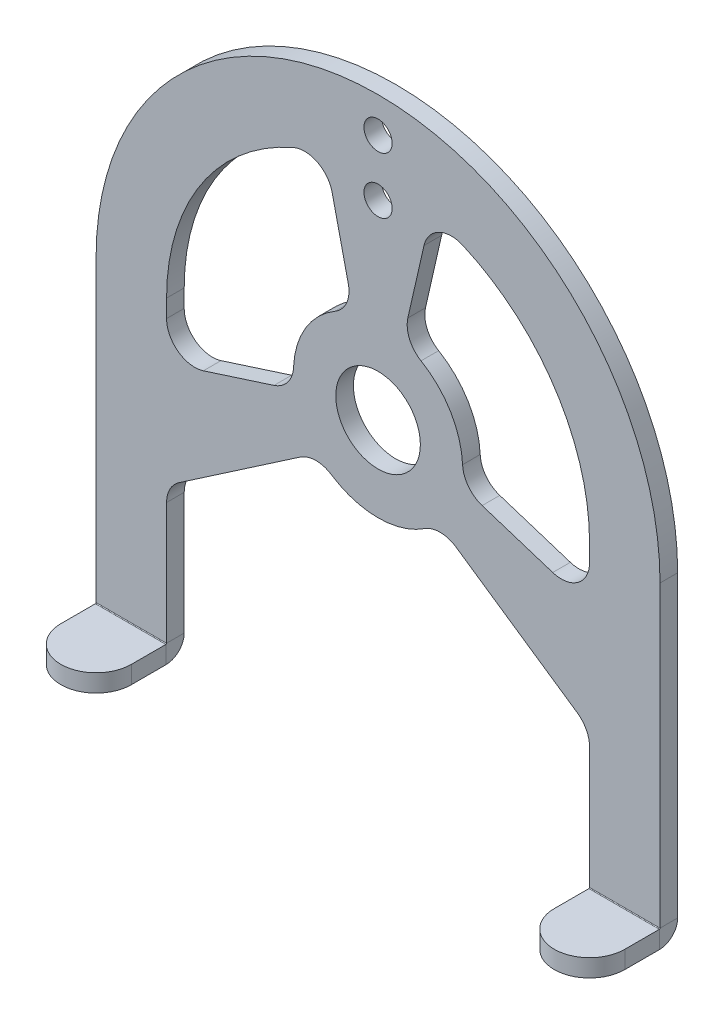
ISO-10303-21;
HEADER;
FILE_DESCRIPTION(('STEP AP214'),'2;1');
FILE_NAME('part.step','',(''),(''),'','','');
FILE_SCHEMA(('AUTOMOTIVE_DESIGN { 1 0 10303 214 1 1 1 1 }'));
ENDSEC;
DATA;
#1=APPLICATION_CONTEXT('core data for automotive mechanical design processes');
#2=APPLICATION_PROTOCOL_DEFINITION('international standard','automotive_design',2000,#1);
#3=PRODUCT_CONTEXT('',#1,'mechanical');
#4=PRODUCT('Part','Part','',(#3));
#5=PRODUCT_RELATED_PRODUCT_CATEGORY('part','',(#4));
#6=PRODUCT_DEFINITION_FORMATION('','',#4);
#7=PRODUCT_DEFINITION_CONTEXT('part definition',#1,'design');
#8=PRODUCT_DEFINITION('design','',#6,#7);
#9=PRODUCT_DEFINITION_SHAPE('','',#8);
#10=(LENGTH_UNIT() NAMED_UNIT(*) SI_UNIT(.MILLI.,.METRE.));
#11=(NAMED_UNIT(*) PLANE_ANGLE_UNIT() SI_UNIT($,.RADIAN.));
#12=(NAMED_UNIT(*) SI_UNIT($,.STERADIAN.) SOLID_ANGLE_UNIT());
#13=UNCERTAINTY_MEASURE_WITH_UNIT(LENGTH_MEASURE(1.E-05),#10,'distance_accuracy_value','');
#14=(GEOMETRIC_REPRESENTATION_CONTEXT(3) GLOBAL_UNCERTAINTY_ASSIGNED_CONTEXT((#13)) GLOBAL_UNIT_ASSIGNED_CONTEXT((#10,
#11,#12)) REPRESENTATION_CONTEXT('',''));
#15=CARTESIAN_POINT('',(0.,0.,0.));
#16=DIRECTION('',(0.,0.,1.));
#17=DIRECTION('',(1.,0.,0.));
#18=AXIS2_PLACEMENT_3D('',#15,#16,#17);
#19=CARTESIAN_POINT('',(35.,0.,7.49999999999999));
#20=DIRECTION('',(0.,1.,0.));
#21=DIRECTION('',(0.,0.,1.));
#22=AXIS2_PLACEMENT_3D('',#19,#20,#21);
#23=CYLINDRICAL_SURFACE('',#22,5.);
#24=DIRECTION('',(0.,1.,0.));
#25=VECTOR('',#24,1.);
#26=CARTESIAN_POINT('',(30.,0.,7.49999999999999));
#27=LINE('',#26,#25);
#28=CARTESIAN_POINT('',(30.,0.,7.49999999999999));
#29=VERTEX_POINT('',#28);
#30=CARTESIAN_POINT('',(30.,2.49999999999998,7.5));
#31=VERTEX_POINT('',#30);
#32=EDGE_CURVE('E659',#29,#31,#27,.T.);
#33=ORIENTED_EDGE('',*,*,#32,.F.);
#34=CARTESIAN_POINT('',(35.,0.,7.49999999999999));
#35=DIRECTION('',(0.,1.,0.));
#36=DIRECTION('',(0.,0.,1.));
#37=AXIS2_PLACEMENT_3D('',#34,#35,#36);
#38=CIRCLE('',#37,5.);
#39=CARTESIAN_POINT('',(40.,0.,7.49999999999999));
#40=VERTEX_POINT('',#39);
#41=EDGE_CURVE('E81',#40,#29,#38,.F.);
#42=ORIENTED_EDGE('',*,*,#41,.F.);
#43=DIRECTION('',(0.,1.,0.));
#44=VECTOR('',#43,1.);
#45=CARTESIAN_POINT('',(40.,0.,7.49999999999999));
#46=LINE('',#45,#44);
#47=CARTESIAN_POINT('',(40.,2.49999999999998,7.5));
#48=VERTEX_POINT('',#47);
#49=EDGE_CURVE('E360',#48,#40,#46,.F.);
#50=ORIENTED_EDGE('',*,*,#49,.F.);
#51=CARTESIAN_POINT('',(35.,2.49999999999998,7.5));
#52=DIRECTION('',(0.,1.,0.));
#53=DIRECTION('',(0.,0.,1.));
#54=AXIS2_PLACEMENT_3D('',#51,#52,#53);
#55=CIRCLE('',#54,5.);
#56=EDGE_CURVE('E13',#31,#48,#55,.T.);
#57=ORIENTED_EDGE('',*,*,#56,.F.);
#58=EDGE_LOOP('',(#33,#42,#50,#57));
#59=FACE_BOUND('',#58,.T.);
#60=ADVANCED_FACE('F74',(#59),#23,.T.);
#61=CARTESIAN_POINT('',(-35.,0.,7.49999999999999));
#62=DIRECTION('',(0.,1.,0.));
#63=DIRECTION('',(0.,0.,1.));
#64=AXIS2_PLACEMENT_3D('',#61,#62,#63);
#65=CYLINDRICAL_SURFACE('',#64,5.);
#66=DIRECTION('',(0.,1.,0.));
#67=VECTOR('',#66,1.);
#68=CARTESIAN_POINT('',(-40.,0.,7.49999999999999));
#69=LINE('',#68,#67);
#70=CARTESIAN_POINT('',(-40.,0.,7.49999999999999));
#71=VERTEX_POINT('',#70);
#72=CARTESIAN_POINT('',(-40.,2.49999999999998,7.5));
#73=VERTEX_POINT('',#72);
#74=EDGE_CURVE('E649',#71,#73,#69,.T.);
#75=ORIENTED_EDGE('',*,*,#74,.F.);
#76=CARTESIAN_POINT('',(-35.,0.,7.49999999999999));
#77=DIRECTION('',(0.,1.,0.));
#78=DIRECTION('',(0.,0.,1.));
#79=AXIS2_PLACEMENT_3D('',#76,#77,#78);
#80=CIRCLE('',#79,5.);
#81=CARTESIAN_POINT('',(-30.,0.,7.49999999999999));
#82=VERTEX_POINT('',#81);
#83=EDGE_CURVE('E655',#82,#71,#80,.F.);
#84=ORIENTED_EDGE('',*,*,#83,.F.);
#85=DIRECTION('',(0.,1.,0.));
#86=VECTOR('',#85,1.);
#87=CARTESIAN_POINT('',(-30.,0.,7.49999999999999));
#88=LINE('',#87,#86);
#89=CARTESIAN_POINT('',(-30.,2.49999999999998,7.5));
#90=VERTEX_POINT('',#89);
#91=EDGE_CURVE('E652',#90,#82,#88,.F.);
#92=ORIENTED_EDGE('',*,*,#91,.F.);
#93=CARTESIAN_POINT('',(-35.,2.49999999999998,7.5));
#94=DIRECTION('',(0.,1.,0.));
#95=DIRECTION('',(0.,0.,1.));
#96=AXIS2_PLACEMENT_3D('',#93,#94,#95);
#97=CIRCLE('',#96,5.);
#98=EDGE_CURVE('E657',#73,#90,#97,.T.);
#99=ORIENTED_EDGE('',*,*,#98,.F.);
#100=EDGE_LOOP('',(#75,#84,#92,#99));
#101=FACE_BOUND('',#100,.T.);
#102=ADVANCED_FACE('F687',(#101),#65,.T.);
#103=CARTESIAN_POINT('',(0.,45.,2.5));
#104=DIRECTION('',(0.,0.,-1.));
#105=DIRECTION('',(-1.,0.,0.));
#106=AXIS2_PLACEMENT_3D('',#103,#104,#105);
#107=PLANE('',#106);
#108=CARTESIAN_POINT('',(0.,72.,2.5));
#109=DIRECTION('',(0.,0.,1.));
#110=DIRECTION('',(1.,0.,0.));
#111=AXIS2_PLACEMENT_3D('',#108,#109,#110);
#112=CIRCLE('',#111,2.);
#113=CARTESIAN_POINT('',(2.,72.,2.5));
#114=VERTEX_POINT('',#113);
#115=EDGE_CURVE('E1384',#114,#114,#112,.T.);
#116=ORIENTED_EDGE('',*,*,#115,.F.);
#117=EDGE_LOOP('',(#116));
#118=FACE_BOUND('',#117,.T.);
#119=CARTESIAN_POINT('',(0.,80.,2.5));
#120=DIRECTION('',(0.,0.,1.));
#121=DIRECTION('',(1.,0.,0.));
#122=AXIS2_PLACEMENT_3D('',#119,#120,#121);
#123=CIRCLE('',#122,2.);
#124=CARTESIAN_POINT('',(2.,80.,2.5));
#125=VERTEX_POINT('',#124);
#126=EDGE_CURVE('E367',#125,#125,#123,.T.);
#127=ORIENTED_EDGE('',*,*,#126,.F.);
#128=EDGE_LOOP('',(#127));
#129=FACE_BOUND('',#128,.T.);
#130=CARTESIAN_POINT('',(0.,45.,2.5));
#131=DIRECTION('',(0.,0.,-1.));
#132=DIRECTION('',(-1.,0.,0.));
#133=AXIS2_PLACEMENT_3D('',#130,#131,#132);
#134=CIRCLE('',#133,30.);
#135=CARTESIAN_POINT('',(-30.,45.,2.5));
#136=VERTEX_POINT('',#135);
#137=CARTESIAN_POINT('',(-12.0150823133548,72.4888667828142,2.5));
#138=VERTEX_POINT('',#137);
#139=EDGE_CURVE('E497',#136,#138,#134,.T.);
#140=ORIENTED_EDGE('',*,*,#139,.T.);
#141=CARTESIAN_POINT('',(-10.4130713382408,68.8236845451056,2.5));
#142=DIRECTION('',(0.,0.,-1.));
#143=DIRECTION('',(-1.,0.,0.));
#144=AXIS2_PLACEMENT_3D('',#141,#142,#143);
#145=CIRCLE('',#144,4.);
#146=CARTESIAN_POINT('',(-6.51287672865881,69.7116496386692,2.5));
#147=VERTEX_POINT('',#146);
#148=EDGE_CURVE('E612',#138,#147,#145,.T.);
#149=ORIENTED_EDGE('',*,*,#148,.T.);
#150=DIRECTION('',(0.221991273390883,-0.975048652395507,0.));
#151=VECTOR('',#150,1.);
#152=CARTESIAN_POINT('',(-7.5,74.0473750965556,2.5));
#153=LINE('',#152,#151);
#154=CARTESIAN_POINT('',(-4.22674359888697,59.6703043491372,2.5));
#155=VERTEX_POINT('',#154);
#156=EDGE_CURVE('E443',#147,#155,#153,.T.);
#157=ORIENTED_EDGE('',*,*,#156,.T.);
#158=CARTESIAN_POINT('',(-8.126938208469,58.7823392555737,2.5));
#159=DIRECTION('',(0.,0.,-1.));
#160=DIRECTION('',(-1.,0.,0.));
#161=AXIS2_PLACEMENT_3D('',#158,#159,#160);
#162=CIRCLE('',#161,4.);
#163=CARTESIAN_POINT('',(-6.09520365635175,55.3367544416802,2.5));
#164=VERTEX_POINT('',#163);
#165=EDGE_CURVE('E628',#155,#164,#162,.T.);
#166=ORIENTED_EDGE('',*,*,#165,.T.);
#167=CARTESIAN_POINT('',(0.,45.,2.5));
#168=DIRECTION('',(0.,0.,1.));
#169=DIRECTION('',(1.,0.,0.));
#170=AXIS2_PLACEMENT_3D('',#167,#168,#169);
#171=CIRCLE('',#170,12.);
#172=CARTESIAN_POINT('',(-11.9885153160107,45.5248814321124,2.5));
#173=VERTEX_POINT('',#172);
#174=EDGE_CURVE('E436',#164,#173,#171,.T.);
#175=ORIENTED_EDGE('',*,*,#174,.T.);
#176=CARTESIAN_POINT('',(-15.9846870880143,45.6998419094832,2.5));
#177=DIRECTION('',(0.,0.,-1.));
#178=DIRECTION('',(-1.,0.,0.));
#179=AXIS2_PLACEMENT_3D('',#176,#177,#178);
#180=CIRCLE('',#179,4.);
#181=CARTESIAN_POINT('',(-14.7621534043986,41.891244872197,2.5));
#182=VERTEX_POINT('',#181);
#183=EDGE_CURVE('E624',#173,#182,#180,.T.);
#184=ORIENTED_EDGE('',*,*,#183,.T.);
#185=DIRECTION('',(-0.952149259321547,-0.305633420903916,0.));
#186=VECTOR('',#185,1.);
#187=CARTESIAN_POINT('',(-11.8041362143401,42.840748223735,2.5));
#188=LINE('',#187,#186);
#189=CARTESIAN_POINT('',(-24.7774663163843,38.6763977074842,2.5));
#190=VERTEX_POINT('',#189);
#191=EDGE_CURVE('E470',#182,#190,#188,.T.);
#192=ORIENTED_EDGE('',*,*,#191,.T.);
#193=CARTESIAN_POINT('',(-26.,42.4849947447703,2.5));
#194=DIRECTION('',(0.,0.,-1.));
#195=DIRECTION('',(-1.,0.,0.));
#196=AXIS2_PLACEMENT_3D('',#193,#194,#195);
#197=CIRCLE('',#196,4.);
#198=CARTESIAN_POINT('',(-30.,42.4849947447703,2.5));
#199=VERTEX_POINT('',#198);
#200=EDGE_CURVE('E645',#190,#199,#197,.T.);
#201=ORIENTED_EDGE('',*,*,#200,.T.);
#202=DIRECTION('',(0.,1.,0.));
#203=VECTOR('',#202,1.);
#204=CARTESIAN_POINT('',(-30.,0.,2.5));
#205=LINE('',#204,#203);
#206=EDGE_CURVE('E496',#199,#136,#205,.T.);
#207=ORIENTED_EDGE('',*,*,#206,.T.);
#208=EDGE_LOOP('',(#140,#149,#157,#166,#175,#184,#192,#201,#207));
#209=FACE_BOUND('',#208,.T.);
#210=DIRECTION('',(0.,-1.,0.));
#211=VECTOR('',#210,1.);
#212=CARTESIAN_POINT('',(30.,0.,2.5));
#213=LINE('',#212,#211);
#214=CARTESIAN_POINT('',(30.,45.,2.5));
#215=VERTEX_POINT('',#214);
#216=CARTESIAN_POINT('',(30.,42.4849947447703,2.5));
#217=VERTEX_POINT('',#216);
#218=EDGE_CURVE('E501',#215,#217,#213,.T.);
#219=ORIENTED_EDGE('',*,*,#218,.T.);
#220=CARTESIAN_POINT('',(26.,42.4849947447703,2.5));
#221=DIRECTION('',(0.,0.,-1.));
#222=DIRECTION('',(-1.,0.,0.));
#223=AXIS2_PLACEMENT_3D('',#220,#221,#222);
#224=CIRCLE('',#223,4.);
#225=CARTESIAN_POINT('',(24.7774663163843,38.6763977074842,2.5));
#226=VERTEX_POINT('',#225);
#227=EDGE_CURVE('E620',#217,#226,#224,.T.);
#228=ORIENTED_EDGE('',*,*,#227,.T.);
#229=DIRECTION('',(-0.952149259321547,0.305633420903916,0.));
#230=VECTOR('',#229,1.);
#231=CARTESIAN_POINT('',(11.8041362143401,42.840748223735,2.5));
#232=LINE('',#231,#230);
#233=CARTESIAN_POINT('',(14.7621534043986,41.891244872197,2.5));
#234=VERTEX_POINT('',#233);
#235=EDGE_CURVE('E482',#226,#234,#232,.T.);
#236=ORIENTED_EDGE('',*,*,#235,.T.);
#237=CARTESIAN_POINT('',(15.9846870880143,45.6998419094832,2.5));
#238=DIRECTION('',(0.,0.,-1.));
#239=DIRECTION('',(-1.,0.,0.));
#240=AXIS2_PLACEMENT_3D('',#237,#238,#239);
#241=CIRCLE('',#240,4.);
#242=CARTESIAN_POINT('',(11.9885153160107,45.5248814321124,2.5));
#243=VERTEX_POINT('',#242);
#244=EDGE_CURVE('E636',#234,#243,#241,.T.);
#245=ORIENTED_EDGE('',*,*,#244,.T.);
#246=CARTESIAN_POINT('',(0.,45.,2.5));
#247=DIRECTION('',(0.,0.,1.));
#248=DIRECTION('',(1.,0.,0.));
#249=AXIS2_PLACEMENT_3D('',#246,#247,#248);
#250=CIRCLE('',#249,12.);
#251=CARTESIAN_POINT('',(6.09520365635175,55.3367544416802,2.5));
#252=VERTEX_POINT('',#251);
#253=EDGE_CURVE('E485',#243,#252,#250,.T.);
#254=ORIENTED_EDGE('',*,*,#253,.T.);
#255=CARTESIAN_POINT('',(8.126938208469,58.7823392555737,2.5));
#256=DIRECTION('',(0.,0.,-1.));
#257=DIRECTION('',(-1.,0.,0.));
#258=AXIS2_PLACEMENT_3D('',#255,#256,#257);
#259=CIRCLE('',#258,4.);
#260=CARTESIAN_POINT('',(4.22674359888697,59.6703043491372,2.5));
#261=VERTEX_POINT('',#260);
#262=EDGE_CURVE('E632',#252,#261,#259,.T.);
#263=ORIENTED_EDGE('',*,*,#262,.T.);
#264=DIRECTION('',(0.221991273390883,0.975048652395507,0.));
#265=VECTOR('',#264,1.);
#266=CARTESIAN_POINT('',(7.5,74.0473750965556,2.5));
#267=LINE('',#266,#265);
#268=CARTESIAN_POINT('',(6.5128767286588,69.7116496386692,2.5));
#269=VERTEX_POINT('',#268);
#270=EDGE_CURVE('E488',#261,#269,#267,.T.);
#271=ORIENTED_EDGE('',*,*,#270,.T.);
#272=CARTESIAN_POINT('',(10.4130713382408,68.8236845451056,2.5));
#273=DIRECTION('',(0.,0.,-1.));
#274=DIRECTION('',(-1.,0.,0.));
#275=AXIS2_PLACEMENT_3D('',#272,#273,#274);
#276=CIRCLE('',#275,4.);
#277=CARTESIAN_POINT('',(12.0150823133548,72.4888667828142,2.5));
#278=VERTEX_POINT('',#277);
#279=EDGE_CURVE('E616',#269,#278,#276,.T.);
#280=ORIENTED_EDGE('',*,*,#279,.T.);
#281=EDGE_CURVE('E495',#278,#215,#134,.T.);
#282=ORIENTED_EDGE('',*,*,#281,.T.);
#283=EDGE_LOOP('',(#219,#228,#236,#245,#254,#263,#271,#280,#282));
#284=FACE_BOUND('',#283,.T.);
#285=CARTESIAN_POINT('',(0.,45.,2.5));
#286=DIRECTION('',(0.,0.,1.));
#287=DIRECTION('',(1.,0.,0.));
#288=AXIS2_PLACEMENT_3D('',#285,#286,#287);
#289=CIRCLE('',#288,6.);
#290=CARTESIAN_POINT('',(6.,45.,2.5));
#291=VERTEX_POINT('',#290);
#292=EDGE_CURVE('E430',#291,#291,#289,.T.);
#293=ORIENTED_EDGE('',*,*,#292,.F.);
#294=EDGE_LOOP('',(#293));
#295=FACE_BOUND('',#294,.T.);
#296=DIRECTION('',(1.,0.,0.));
#297=VECTOR('',#296,1.);
#298=CARTESIAN_POINT('',(40.,2.6,2.5));
#299=LINE('',#298,#297);
#300=CARTESIAN_POINT('',(40.,2.6,2.5));
#301=VERTEX_POINT('',#300);
#302=CARTESIAN_POINT('',(30.,2.6,2.5));
#303=VERTEX_POINT('',#302);
#304=EDGE_CURVE('E362',#301,#303,#299,.F.);
#305=ORIENTED_EDGE('',*,*,#304,.F.);
#306=DIRECTION('',(0.,1.,0.));
#307=VECTOR('',#306,1.);
#308=CARTESIAN_POINT('',(40.,0.,2.5));
#309=LINE('',#308,#307);
#310=CARTESIAN_POINT('',(40.,45.,2.5));
#311=VERTEX_POINT('',#310);
#312=EDGE_CURVE('E504',#301,#311,#309,.T.);
#313=ORIENTED_EDGE('',*,*,#312,.T.);
#314=CARTESIAN_POINT('',(0.,45.,2.5));
#315=DIRECTION('',(0.,0.,1.));
#316=DIRECTION('',(1.,0.,0.));
#317=AXIS2_PLACEMENT_3D('',#314,#315,#316);
#318=CIRCLE('',#317,40.);
#319=CARTESIAN_POINT('',(-40.,45.,2.5));
#320=VERTEX_POINT('',#319);
#321=EDGE_CURVE('E506',#311,#320,#318,.T.);
#322=ORIENTED_EDGE('',*,*,#321,.T.);
#323=DIRECTION('',(0.,-1.,0.));
#324=VECTOR('',#323,1.);
#325=CARTESIAN_POINT('',(-40.,0.,2.5));
#326=LINE('',#325,#324);
#327=CARTESIAN_POINT('',(-40.,2.6,2.5));
#328=VERTEX_POINT('',#327);
#329=EDGE_CURVE('E508',#320,#328,#326,.T.);
#330=ORIENTED_EDGE('',*,*,#329,.T.);
#331=DIRECTION('',(1.,0.,0.));
#332=VECTOR('',#331,1.);
#333=CARTESIAN_POINT('',(-30.,2.6,2.5));
#334=LINE('',#333,#332);
#335=CARTESIAN_POINT('',(-30.,2.6,2.5));
#336=VERTEX_POINT('',#335);
#337=EDGE_CURVE('E423',#336,#328,#334,.F.);
#338=ORIENTED_EDGE('',*,*,#337,.F.);
#339=CARTESIAN_POINT('',(-30.,19.8880053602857,2.5));
#340=VERTEX_POINT('',#339);
#341=EDGE_CURVE('E493',#336,#340,#205,.T.);
#342=ORIENTED_EDGE('',*,*,#341,.T.);
#343=CARTESIAN_POINT('',(-26.,19.8880053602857,2.5));
#344=DIRECTION('',(0.,0.,-1.));
#345=DIRECTION('',(-1.,0.,0.));
#346=AXIS2_PLACEMENT_3D('',#343,#344,#345);
#347=CIRCLE('',#346,4.);
#348=CARTESIAN_POINT('',(-28.2559500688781,23.1911386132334,2.5));
#349=VERTEX_POINT('',#348);
#350=EDGE_CURVE('E640',#340,#349,#347,.T.);
#351=ORIENTED_EDGE('',*,*,#350,.T.);
#352=DIRECTION('',(0.825783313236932,0.563987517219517,0.));
#353=VECTOR('',#352,1.);
#354=CARTESIAN_POINT('',(-8.59099585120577,36.621766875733,2.5));
#355=LINE('',#354,#353);
#356=CARTESIAN_POINT('',(-11.0542887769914,34.9394048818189,2.5));
#357=VERTEX_POINT('',#356);
#358=EDGE_CURVE('E473',#349,#357,#355,.T.);
#359=ORIENTED_EDGE('',*,*,#358,.T.);
#360=CARTESIAN_POINT('',(-8.79833870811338,31.6362716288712,2.5));
#361=DIRECTION('',(0.,0.,-1.));
#362=DIRECTION('',(-1.,0.,0.));
#363=AXIS2_PLACEMENT_3D('',#360,#361,#362);
#364=CIRCLE('',#363,4.);
#365=CARTESIAN_POINT('',(-6.59875403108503,34.9772037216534,2.5));
#366=VERTEX_POINT('',#365);
#367=EDGE_CURVE('E608',#357,#366,#364,.T.);
#368=ORIENTED_EDGE('',*,*,#367,.T.);
#369=CARTESIAN_POINT('',(0.,45.,2.5));
#370=DIRECTION('',(0.,0.,1.));
#371=DIRECTION('',(1.,0.,0.));
#372=AXIS2_PLACEMENT_3D('',#369,#370,#371);
#373=CIRCLE('',#372,12.);
#374=CARTESIAN_POINT('',(6.59875403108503,34.9772037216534,2.5));
#375=VERTEX_POINT('',#374);
#376=EDGE_CURVE('E476',#366,#375,#373,.T.);
#377=ORIENTED_EDGE('',*,*,#376,.T.);
#378=CARTESIAN_POINT('',(8.79833870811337,31.6362716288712,2.5));
#379=DIRECTION('',(0.,0.,-1.));
#380=DIRECTION('',(-1.,0.,0.));
#381=AXIS2_PLACEMENT_3D('',#378,#379,#380);
#382=CIRCLE('',#381,4.);
#383=CARTESIAN_POINT('',(11.0542887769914,34.9394048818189,2.5));
#384=VERTEX_POINT('',#383);
#385=EDGE_CURVE('E604',#375,#384,#382,.T.);
#386=ORIENTED_EDGE('',*,*,#385,.T.);
#387=DIRECTION('',(0.825783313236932,-0.563987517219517,0.));
#388=VECTOR('',#387,1.);
#389=CARTESIAN_POINT('',(8.59099585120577,36.621766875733,2.5));
#390=LINE('',#389,#388);
#391=CARTESIAN_POINT('',(28.2559500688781,23.1911386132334,2.5));
#392=VERTEX_POINT('',#391);
#393=EDGE_CURVE('E479',#384,#392,#390,.T.);
#394=ORIENTED_EDGE('',*,*,#393,.T.);
#395=CARTESIAN_POINT('',(26.,19.8880053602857,2.5));
#396=DIRECTION('',(0.,0.,-1.));
#397=DIRECTION('',(-1.,0.,0.));
#398=AXIS2_PLACEMENT_3D('',#395,#396,#397);
#399=CIRCLE('',#398,4.);
#400=CARTESIAN_POINT('',(30.,19.8880053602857,2.5));
#401=VERTEX_POINT('',#400);
#402=EDGE_CURVE('E600',#392,#401,#399,.T.);
#403=ORIENTED_EDGE('',*,*,#402,.T.);
#404=EDGE_CURVE('E500',#401,#303,#213,.T.);
#405=ORIENTED_EDGE('',*,*,#404,.T.);
#406=EDGE_LOOP('',(#305,#313,#322,#330,#338,#342,#351,#359,#368,#377,#386,#394,#403,#405));
#407=FACE_BOUND('',#406,.T.);
#408=ADVANCED_FACE('F691',(#118,#129,#209,#284,#295,#407),#107,.F.);
#409=CARTESIAN_POINT('',(0.,45.,0.));
#410=DIRECTION('',(0.,0.,-1.));
#411=DIRECTION('',(-1.,0.,0.));
#412=AXIS2_PLACEMENT_3D('',#409,#410,#411);
#413=PLANE('',#412);
#414=CARTESIAN_POINT('',(0.,72.,0.));
#415=DIRECTION('',(0.,0.,1.));
#416=DIRECTION('',(1.,0.,0.));
#417=AXIS2_PLACEMENT_3D('',#414,#415,#416);
#418=CIRCLE('',#417,2.);
#419=CARTESIAN_POINT('',(2.,72.,0.));
#420=VERTEX_POINT('',#419);
#421=EDGE_CURVE('E1381',#420,#420,#418,.T.);
#422=ORIENTED_EDGE('',*,*,#421,.T.);
#423=EDGE_LOOP('',(#422));
#424=FACE_BOUND('',#423,.T.);
#425=CARTESIAN_POINT('',(0.,80.,0.));
#426=DIRECTION('',(0.,0.,1.));
#427=DIRECTION('',(1.,0.,0.));
#428=AXIS2_PLACEMENT_3D('',#425,#426,#427);
#429=CIRCLE('',#428,2.);
#430=CARTESIAN_POINT('',(2.,80.,0.));
#431=VERTEX_POINT('',#430);
#432=EDGE_CURVE('E376',#431,#431,#429,.T.);
#433=ORIENTED_EDGE('',*,*,#432,.T.);
#434=EDGE_LOOP('',(#433));
#435=FACE_BOUND('',#434,.T.);
#436=DIRECTION('',(0.221991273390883,-0.975048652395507,0.));
#437=VECTOR('',#436,1.);
#438=CARTESIAN_POINT('',(-7.5,74.0473750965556,0.));
#439=LINE('',#438,#437);
#440=CARTESIAN_POINT('',(-6.51287672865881,69.7116496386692,0.));
#441=VERTEX_POINT('',#440);
#442=CARTESIAN_POINT('',(-4.22674359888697,59.6703043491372,0.));
#443=VERTEX_POINT('',#442);
#444=EDGE_CURVE('E464',#441,#443,#439,.T.);
#445=ORIENTED_EDGE('',*,*,#444,.F.);
#446=CARTESIAN_POINT('',(-10.4130713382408,68.8236845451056,0.));
#447=DIRECTION('',(0.,0.,-1.));
#448=DIRECTION('',(-1.,0.,0.));
#449=AXIS2_PLACEMENT_3D('',#446,#447,#448);
#450=CIRCLE('',#449,4.);
#451=CARTESIAN_POINT('',(-12.0150823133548,72.4888667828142,0.));
#452=VERTEX_POINT('',#451);
#453=EDGE_CURVE('E614',#441,#452,#450,.F.);
#454=ORIENTED_EDGE('',*,*,#453,.T.);
#455=CARTESIAN_POINT('',(0.,45.,0.));
#456=DIRECTION('',(0.,0.,-1.));
#457=DIRECTION('',(1.,0.,0.));
#458=AXIS2_PLACEMENT_3D('',#455,#456,#457);
#459=CIRCLE('',#458,30.);
#460=CARTESIAN_POINT('',(-30.,45.,0.));
#461=VERTEX_POINT('',#460);
#462=EDGE_CURVE('E515',#461,#452,#459,.T.);
#463=ORIENTED_EDGE('',*,*,#462,.F.);
#464=DIRECTION('',(0.,1.,0.));
#465=VECTOR('',#464,1.);
#466=CARTESIAN_POINT('',(-30.,0.,0.));
#467=LINE('',#466,#465);
#468=CARTESIAN_POINT('',(-30.,42.4849947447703,0.));
#469=VERTEX_POINT('',#468);
#470=EDGE_CURVE('E467',#469,#461,#467,.T.);
#471=ORIENTED_EDGE('',*,*,#470,.F.);
#472=CARTESIAN_POINT('',(-26.,42.4849947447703,0.));
#473=DIRECTION('',(0.,0.,-1.));
#474=DIRECTION('',(-1.,0.,0.));
#475=AXIS2_PLACEMENT_3D('',#472,#473,#474);
#476=CIRCLE('',#475,4.);
#477=CARTESIAN_POINT('',(-24.7774663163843,38.6763977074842,0.));
#478=VERTEX_POINT('',#477);
#479=EDGE_CURVE('E647',#469,#478,#476,.F.);
#480=ORIENTED_EDGE('',*,*,#479,.T.);
#481=DIRECTION('',(-0.952149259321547,-0.305633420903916,0.));
#482=VECTOR('',#481,1.);
#483=CARTESIAN_POINT('',(-11.8041362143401,42.840748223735,0.));
#484=LINE('',#483,#482);
#485=CARTESIAN_POINT('',(-14.7621534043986,41.891244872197,0.));
#486=VERTEX_POINT('',#485);
#487=EDGE_CURVE('E442',#486,#478,#484,.T.);
#488=ORIENTED_EDGE('',*,*,#487,.F.);
#489=CARTESIAN_POINT('',(-15.9846870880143,45.6998419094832,0.));
#490=DIRECTION('',(0.,0.,-1.));
#491=DIRECTION('',(-1.,0.,0.));
#492=AXIS2_PLACEMENT_3D('',#489,#490,#491);
#493=CIRCLE('',#492,4.);
#494=CARTESIAN_POINT('',(-11.9885153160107,45.5248814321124,0.));
#495=VERTEX_POINT('',#494);
#496=EDGE_CURVE('E626',#486,#495,#493,.F.);
#497=ORIENTED_EDGE('',*,*,#496,.T.);
#498=CARTESIAN_POINT('',(0.,45.,0.));
#499=DIRECTION('',(0.,0.,1.));
#500=DIRECTION('',(1.,0.,0.));
#501=AXIS2_PLACEMENT_3D('',#498,#499,#500);
#502=CIRCLE('',#501,12.);
#503=CARTESIAN_POINT('',(-6.09520365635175,55.3367544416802,0.));
#504=VERTEX_POINT('',#503);
#505=EDGE_CURVE('E439',#504,#495,#502,.T.);
#506=ORIENTED_EDGE('',*,*,#505,.F.);
#507=CARTESIAN_POINT('',(-8.126938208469,58.7823392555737,0.));
#508=DIRECTION('',(0.,0.,-1.));
#509=DIRECTION('',(-1.,0.,0.));
#510=AXIS2_PLACEMENT_3D('',#507,#508,#509);
#511=CIRCLE('',#510,4.);
#512=EDGE_CURVE('E630',#504,#443,#511,.F.);
#513=ORIENTED_EDGE('',*,*,#512,.T.);
#514=EDGE_LOOP('',(#445,#454,#463,#471,#480,#488,#497,#506,#513));
#515=FACE_BOUND('',#514,.T.);
#516=DIRECTION('',(-0.952149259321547,0.305633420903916,0.));
#517=VECTOR('',#516,1.);
#518=CARTESIAN_POINT('',(11.8041362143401,42.840748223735,0.));
#519=LINE('',#518,#517);
#520=CARTESIAN_POINT('',(24.7774663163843,38.6763977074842,0.));
#521=VERTEX_POINT('',#520);
#522=CARTESIAN_POINT('',(14.7621534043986,41.891244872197,0.));
#523=VERTEX_POINT('',#522);
#524=EDGE_CURVE('E455',#521,#523,#519,.T.);
#525=ORIENTED_EDGE('',*,*,#524,.F.);
#526=CARTESIAN_POINT('',(26.,42.4849947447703,0.));
#527=DIRECTION('',(0.,0.,-1.));
#528=DIRECTION('',(-1.,0.,0.));
#529=AXIS2_PLACEMENT_3D('',#526,#527,#528);
#530=CIRCLE('',#529,4.);
#531=CARTESIAN_POINT('',(30.,42.4849947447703,0.));
#532=VERTEX_POINT('',#531);
#533=EDGE_CURVE('E622',#521,#532,#530,.F.);
#534=ORIENTED_EDGE('',*,*,#533,.T.);
#535=DIRECTION('',(0.,-1.,0.));
#536=VECTOR('',#535,1.);
#537=CARTESIAN_POINT('',(30.,0.,0.));
#538=LINE('',#537,#536);
#539=CARTESIAN_POINT('',(30.,45.,0.));
#540=VERTEX_POINT('',#539);
#541=EDGE_CURVE('E519',#540,#532,#538,.T.);
#542=ORIENTED_EDGE('',*,*,#541,.F.);
#543=CARTESIAN_POINT('',(12.0150823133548,72.4888667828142,0.));
#544=VERTEX_POINT('',#543);
#545=EDGE_CURVE('E514',#544,#540,#459,.T.);
#546=ORIENTED_EDGE('',*,*,#545,.F.);
#547=CARTESIAN_POINT('',(10.4130713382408,68.8236845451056,0.));
#548=DIRECTION('',(0.,0.,-1.));
#549=DIRECTION('',(-1.,0.,0.));
#550=AXIS2_PLACEMENT_3D('',#547,#548,#549);
#551=CIRCLE('',#550,4.);
#552=CARTESIAN_POINT('',(6.5128767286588,69.7116496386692,0.));
#553=VERTEX_POINT('',#552);
#554=EDGE_CURVE('E618',#544,#553,#551,.F.);
#555=ORIENTED_EDGE('',*,*,#554,.T.);
#556=DIRECTION('',(0.221991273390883,0.975048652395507,0.));
#557=VECTOR('',#556,1.);
#558=CARTESIAN_POINT('',(7.5,74.0473750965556,0.));
#559=LINE('',#558,#557);
#560=CARTESIAN_POINT('',(4.22674359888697,59.6703043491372,0.));
#561=VERTEX_POINT('',#560);
#562=EDGE_CURVE('E461',#561,#553,#559,.T.);
#563=ORIENTED_EDGE('',*,*,#562,.F.);
#564=CARTESIAN_POINT('',(8.126938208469,58.7823392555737,0.));
#565=DIRECTION('',(0.,0.,-1.));
#566=DIRECTION('',(-1.,0.,0.));
#567=AXIS2_PLACEMENT_3D('',#564,#565,#566);
#568=CIRCLE('',#567,4.);
#569=CARTESIAN_POINT('',(6.09520365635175,55.3367544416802,0.));
#570=VERTEX_POINT('',#569);
#571=EDGE_CURVE('E634',#561,#570,#568,.F.);
#572=ORIENTED_EDGE('',*,*,#571,.T.);
#573=CARTESIAN_POINT('',(0.,45.,0.));
#574=DIRECTION('',(0.,0.,1.));
#575=DIRECTION('',(1.,0.,0.));
#576=AXIS2_PLACEMENT_3D('',#573,#574,#575);
#577=CIRCLE('',#576,12.);
#578=CARTESIAN_POINT('',(11.9885153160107,45.5248814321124,0.));
#579=VERTEX_POINT('',#578);
#580=EDGE_CURVE('E458',#579,#570,#577,.T.);
#581=ORIENTED_EDGE('',*,*,#580,.F.);
#582=CARTESIAN_POINT('',(15.9846870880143,45.6998419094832,0.));
#583=DIRECTION('',(0.,0.,-1.));
#584=DIRECTION('',(-1.,0.,0.));
#585=AXIS2_PLACEMENT_3D('',#582,#583,#584);
#586=CIRCLE('',#585,4.);
#587=EDGE_CURVE('E638',#579,#523,#586,.F.);
#588=ORIENTED_EDGE('',*,*,#587,.T.);
#589=EDGE_LOOP('',(#525,#534,#542,#546,#555,#563,#572,#581,#588));
#590=FACE_BOUND('',#589,.T.);
#591=CARTESIAN_POINT('',(0.,45.,0.));
#592=DIRECTION('',(0.,0.,1.));
#593=DIRECTION('',(1.,0.,0.));
#594=AXIS2_PLACEMENT_3D('',#591,#592,#593);
#595=CIRCLE('',#594,6.);
#596=CARTESIAN_POINT('',(6.,45.,0.));
#597=VERTEX_POINT('',#596);
#598=EDGE_CURVE('E433',#597,#597,#595,.T.);
#599=ORIENTED_EDGE('',*,*,#598,.T.);
#600=EDGE_LOOP('',(#599));
#601=FACE_BOUND('',#600,.T.);
#602=DIRECTION('',(0.,1.,0.));
#603=VECTOR('',#602,1.);
#604=CARTESIAN_POINT('',(40.,0.,0.));
#605=LINE('',#604,#603);
#606=CARTESIAN_POINT('',(40.,2.6,0.));
#607=VERTEX_POINT('',#606);
#608=CARTESIAN_POINT('',(40.,45.,0.));
#609=VERTEX_POINT('',#608);
#610=EDGE_CURVE('E522',#607,#609,#605,.T.);
#611=ORIENTED_EDGE('',*,*,#610,.F.);
#612=DIRECTION('',(1.,0.,0.));
#613=VECTOR('',#612,1.);
#614=CARTESIAN_POINT('',(40.,2.6,0.));
#615=LINE('',#614,#613);
#616=CARTESIAN_POINT('',(30.,2.60000000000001,0.));
#617=VERTEX_POINT('',#616);
#618=EDGE_CURVE('E335',#607,#617,#615,.F.);
#619=ORIENTED_EDGE('',*,*,#618,.T.);
#620=CARTESIAN_POINT('',(30.,19.8880053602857,0.));
#621=VERTEX_POINT('',#620);
#622=EDGE_CURVE('E518',#621,#617,#538,.T.);
#623=ORIENTED_EDGE('',*,*,#622,.F.);
#624=CARTESIAN_POINT('',(26.,19.8880053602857,0.));
#625=DIRECTION('',(0.,0.,-1.));
#626=DIRECTION('',(-1.,0.,0.));
#627=AXIS2_PLACEMENT_3D('',#624,#625,#626);
#628=CIRCLE('',#627,4.);
#629=CARTESIAN_POINT('',(28.2559500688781,23.1911386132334,0.));
#630=VERTEX_POINT('',#629);
#631=EDGE_CURVE('E602',#621,#630,#628,.F.);
#632=ORIENTED_EDGE('',*,*,#631,.T.);
#633=DIRECTION('',(0.825783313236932,-0.563987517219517,0.));
#634=VECTOR('',#633,1.);
#635=CARTESIAN_POINT('',(8.59099585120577,36.621766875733,0.));
#636=LINE('',#635,#634);
#637=CARTESIAN_POINT('',(11.0542887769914,34.9394048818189,0.));
#638=VERTEX_POINT('',#637);
#639=EDGE_CURVE('E452',#638,#630,#636,.T.);
#640=ORIENTED_EDGE('',*,*,#639,.F.);
#641=CARTESIAN_POINT('',(8.79833870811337,31.6362716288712,0.));
#642=DIRECTION('',(0.,0.,-1.));
#643=DIRECTION('',(-1.,0.,0.));
#644=AXIS2_PLACEMENT_3D('',#641,#642,#643);
#645=CIRCLE('',#644,4.);
#646=CARTESIAN_POINT('',(6.59875403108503,34.9772037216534,0.));
#647=VERTEX_POINT('',#646);
#648=EDGE_CURVE('E606',#638,#647,#645,.F.);
#649=ORIENTED_EDGE('',*,*,#648,.T.);
#650=CARTESIAN_POINT('',(0.,45.,0.));
#651=DIRECTION('',(0.,0.,1.));
#652=DIRECTION('',(1.,0.,0.));
#653=AXIS2_PLACEMENT_3D('',#650,#651,#652);
#654=CIRCLE('',#653,12.);
#655=CARTESIAN_POINT('',(-6.59875403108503,34.9772037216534,0.));
#656=VERTEX_POINT('',#655);
#657=EDGE_CURVE('E449',#656,#647,#654,.T.);
#658=ORIENTED_EDGE('',*,*,#657,.F.);
#659=CARTESIAN_POINT('',(-8.79833870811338,31.6362716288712,0.));
#660=DIRECTION('',(0.,0.,-1.));
#661=DIRECTION('',(-1.,0.,0.));
#662=AXIS2_PLACEMENT_3D('',#659,#660,#661);
#663=CIRCLE('',#662,4.);
#664=CARTESIAN_POINT('',(-11.0542887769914,34.9394048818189,0.));
#665=VERTEX_POINT('',#664);
#666=EDGE_CURVE('E610',#656,#665,#663,.F.);
#667=ORIENTED_EDGE('',*,*,#666,.T.);
#668=DIRECTION('',(0.825783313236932,0.563987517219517,0.));
#669=VECTOR('',#668,1.);
#670=CARTESIAN_POINT('',(-8.59099585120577,36.621766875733,0.));
#671=LINE('',#670,#669);
#672=CARTESIAN_POINT('',(-28.2559500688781,23.1911386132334,0.));
#673=VERTEX_POINT('',#672);
#674=EDGE_CURVE('E446',#673,#665,#671,.T.);
#675=ORIENTED_EDGE('',*,*,#674,.F.);
#676=CARTESIAN_POINT('',(-26.,19.8880053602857,0.));
#677=DIRECTION('',(0.,0.,-1.));
#678=DIRECTION('',(-1.,0.,0.));
#679=AXIS2_PLACEMENT_3D('',#676,#677,#678);
#680=CIRCLE('',#679,4.);
#681=CARTESIAN_POINT('',(-30.,19.8880053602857,0.));
#682=VERTEX_POINT('',#681);
#683=EDGE_CURVE('E642',#673,#682,#680,.F.);
#684=ORIENTED_EDGE('',*,*,#683,.T.);
#685=CARTESIAN_POINT('',(-30.,2.6,0.));
#686=VERTEX_POINT('',#685);
#687=EDGE_CURVE('E512',#686,#682,#467,.T.);
#688=ORIENTED_EDGE('',*,*,#687,.F.);
#689=DIRECTION('',(1.,0.,0.));
#690=VECTOR('',#689,1.);
#691=CARTESIAN_POINT('',(-30.,2.6,0.));
#692=LINE('',#691,#690);
#693=CARTESIAN_POINT('',(-40.,2.60000000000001,0.));
#694=VERTEX_POINT('',#693);
#695=EDGE_CURVE('E410',#686,#694,#692,.F.);
#696=ORIENTED_EDGE('',*,*,#695,.T.);
#697=DIRECTION('',(0.,-1.,0.));
#698=VECTOR('',#697,1.);
#699=CARTESIAN_POINT('',(-40.,0.,0.));
#700=LINE('',#699,#698);
#701=CARTESIAN_POINT('',(-40.,45.,0.));
#702=VERTEX_POINT('',#701);
#703=EDGE_CURVE('E526',#702,#694,#700,.T.);
#704=ORIENTED_EDGE('',*,*,#703,.F.);
#705=CARTESIAN_POINT('',(0.,45.,0.));
#706=DIRECTION('',(0.,0.,1.));
#707=DIRECTION('',(-1.,0.,0.));
#708=AXIS2_PLACEMENT_3D('',#705,#706,#707);
#709=CIRCLE('',#708,40.);
#710=EDGE_CURVE('E524',#609,#702,#709,.T.);
#711=ORIENTED_EDGE('',*,*,#710,.F.);
#712=EDGE_LOOP('',(#611,#619,#623,#632,#640,#649,#658,#667,#675,#684,#688,#696,#704,#711));
#713=FACE_BOUND('',#712,.T.);
#714=ADVANCED_FACE('F696',(#424,#435,#515,#590,#601,#713),#413,.T.);
#715=CARTESIAN_POINT('',(30.,0.,2.5));
#716=DIRECTION('',(1.,0.,0.));
#717=DIRECTION('',(0.,0.,-1.));
#718=AXIS2_PLACEMENT_3D('',#715,#716,#717);
#719=PLANE('',#718);
#720=DIRECTION('',(0.,0.,-1.));
#721=VECTOR('',#720,1.);
#722=CARTESIAN_POINT('',(30.,2.6,2.5));
#723=LINE('',#722,#721);
#724=EDGE_CURVE('E384',#303,#617,#723,.T.);
#725=ORIENTED_EDGE('',*,*,#724,.F.);
#726=ORIENTED_EDGE('',*,*,#404,.F.);
#727=DIRECTION('',(0.,0.,1.));
#728=VECTOR('',#727,1.);
#729=CARTESIAN_POINT('',(30.,19.8880053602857,2.5));
#730=LINE('',#729,#728);
#731=EDGE_CURVE('E545',#401,#621,#730,.F.);
#732=ORIENTED_EDGE('',*,*,#731,.T.);
#733=ORIENTED_EDGE('',*,*,#622,.T.);
#734=EDGE_LOOP('',(#725,#726,#732,#733));
#735=FACE_BOUND('',#734,.T.);
#736=ADVANCED_FACE('F763',(#735),#719,.F.);
#737=CARTESIAN_POINT('',(40.,0.,2.5));
#738=DIRECTION('',(-1.,0.,0.));
#739=DIRECTION('',(0.,0.,1.));
#740=AXIS2_PLACEMENT_3D('',#737,#738,#739);
#741=PLANE('',#740);
#742=DIRECTION('',(0.,0.,-1.));
#743=VECTOR('',#742,1.);
#744=CARTESIAN_POINT('',(40.,2.6,2.5));
#745=LINE('',#744,#743);
#746=EDGE_CURVE('E379',#301,#607,#745,.T.);
#747=ORIENTED_EDGE('',*,*,#746,.T.);
#748=ORIENTED_EDGE('',*,*,#610,.T.);
#749=DIRECTION('',(0.,0.,-1.));
#750=VECTOR('',#749,1.);
#751=CARTESIAN_POINT('',(40.,45.,2.5));
#752=LINE('',#751,#750);
#753=EDGE_CURVE('E531',#311,#609,#752,.T.);
#754=ORIENTED_EDGE('',*,*,#753,.F.);
#755=ORIENTED_EDGE('',*,*,#312,.F.);
#756=EDGE_LOOP('',(#747,#748,#754,#755));
#757=FACE_BOUND('',#756,.T.);
#758=ADVANCED_FACE('F766',(#757),#741,.F.);
#759=CARTESIAN_POINT('',(-30.,0.,2.5));
#760=DIRECTION('',(-1.,0.,0.));
#761=DIRECTION('',(0.,0.,1.));
#762=AXIS2_PLACEMENT_3D('',#759,#760,#761);
#763=PLANE('',#762);
#764=DIRECTION('',(0.,0.,-1.));
#765=VECTOR('',#764,1.);
#766=CARTESIAN_POINT('',(-30.,2.6,2.5));
#767=LINE('',#766,#765);
#768=EDGE_CURVE('E417',#336,#686,#767,.T.);
#769=ORIENTED_EDGE('',*,*,#768,.T.);
#770=ORIENTED_EDGE('',*,*,#687,.T.);
#771=DIRECTION('',(0.,0.,1.));
#772=VECTOR('',#771,1.);
#773=CARTESIAN_POINT('',(-30.,19.8880053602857,2.5));
#774=LINE('',#773,#772);
#775=EDGE_CURVE('E595',#682,#340,#774,.T.);
#776=ORIENTED_EDGE('',*,*,#775,.T.);
#777=ORIENTED_EDGE('',*,*,#341,.F.);
#778=EDGE_LOOP('',(#769,#770,#776,#777));
#779=FACE_BOUND('',#778,.T.);
#780=ADVANCED_FACE('F757',(#779),#763,.F.);
#781=CARTESIAN_POINT('',(-40.,0.,2.5));
#782=DIRECTION('',(1.,0.,0.));
#783=DIRECTION('',(0.,0.,-1.));
#784=AXIS2_PLACEMENT_3D('',#781,#782,#783);
#785=PLANE('',#784);
#786=DIRECTION('',(0.,0.,-1.));
#787=VECTOR('',#786,1.);
#788=CARTESIAN_POINT('',(-40.,2.6,2.5));
#789=LINE('',#788,#787);
#790=EDGE_CURVE('E427',#328,#694,#789,.T.);
#791=ORIENTED_EDGE('',*,*,#790,.F.);
#792=ORIENTED_EDGE('',*,*,#329,.F.);
#793=DIRECTION('',(0.,0.,-1.));
#794=VECTOR('',#793,1.);
#795=CARTESIAN_POINT('',(-40.,45.,2.5));
#796=LINE('',#795,#794);
#797=EDGE_CURVE('E511',#320,#702,#796,.T.);
#798=ORIENTED_EDGE('',*,*,#797,.T.);
#799=ORIENTED_EDGE('',*,*,#703,.T.);
#800=EDGE_LOOP('',(#791,#792,#798,#799));
#801=FACE_BOUND('',#800,.T.);
#802=ADVANCED_FACE('F775',(#801),#785,.F.);
#803=CARTESIAN_POINT('',(0.,45.,2.5));
#804=DIRECTION('',(0.,0.,-1.));
#805=DIRECTION('',(-1.,0.,0.));
#806=AXIS2_PLACEMENT_3D('',#803,#804,#805);
#807=CYLINDRICAL_SURFACE('',#806,30.);
#808=ORIENTED_EDGE('',*,*,#462,.T.);
#809=DIRECTION('',(0.,0.,-1.));
#810=VECTOR('',#809,1.);
#811=CARTESIAN_POINT('',(-12.0150823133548,72.4888667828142,2.5));
#812=LINE('',#811,#810);
#813=EDGE_CURVE('E557',#452,#138,#812,.F.);
#814=ORIENTED_EDGE('',*,*,#813,.T.);
#815=ORIENTED_EDGE('',*,*,#139,.F.);
#816=DIRECTION('',(0.,0.,-1.));
#817=VECTOR('',#816,1.);
#818=CARTESIAN_POINT('',(-30.,45.,2.5));
#819=LINE('',#818,#817);
#820=EDGE_CURVE('E537',#136,#461,#819,.T.);
#821=ORIENTED_EDGE('',*,*,#820,.T.);
#822=EDGE_LOOP('',(#808,#814,#815,#821));
#823=FACE_BOUND('',#822,.T.);
#824=ADVANCED_FACE('F762',(#823),#807,.F.);
#825=ORIENTED_EDGE('',*,*,#541,.T.);
#826=DIRECTION('',(0.,0.,1.));
#827=VECTOR('',#826,1.);
#828=CARTESIAN_POINT('',(30.,42.4849947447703,2.5));
#829=LINE('',#828,#827);
#830=EDGE_CURVE('E572',#532,#217,#829,.T.);
#831=ORIENTED_EDGE('',*,*,#830,.T.);
#832=ORIENTED_EDGE('',*,*,#218,.F.);
#833=DIRECTION('',(0.,0.,-1.));
#834=VECTOR('',#833,1.);
#835=CARTESIAN_POINT('',(30.,45.,2.5));
#836=LINE('',#835,#834);
#837=EDGE_CURVE('E534',#215,#540,#836,.T.);
#838=ORIENTED_EDGE('',*,*,#837,.T.);
#839=EDGE_LOOP('',(#825,#831,#832,#838));
#840=FACE_BOUND('',#839,.T.);
#841=ADVANCED_FACE('F755',(#840),#719,.F.);
#842=ORIENTED_EDGE('',*,*,#206,.F.);
#843=DIRECTION('',(0.,0.,1.));
#844=VECTOR('',#843,1.);
#845=CARTESIAN_POINT('',(-30.,42.4849947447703,2.5));
#846=LINE('',#845,#844);
#847=EDGE_CURVE('E598',#199,#469,#846,.F.);
#848=ORIENTED_EDGE('',*,*,#847,.T.);
#849=ORIENTED_EDGE('',*,*,#470,.T.);
#850=ORIENTED_EDGE('',*,*,#820,.F.);
#851=EDGE_LOOP('',(#842,#848,#849,#850));
#852=FACE_BOUND('',#851,.T.);
#853=ADVANCED_FACE('F751',(#852),#763,.F.);
#854=ORIENTED_EDGE('',*,*,#281,.F.);
#855=DIRECTION('',(0.,0.,-1.));
#856=VECTOR('',#855,1.);
#857=CARTESIAN_POINT('',(12.0150823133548,72.4888667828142,2.5));
#858=LINE('',#857,#856);
#859=EDGE_CURVE('E570',#278,#544,#858,.T.);
#860=ORIENTED_EDGE('',*,*,#859,.T.);
#861=ORIENTED_EDGE('',*,*,#545,.T.);
#862=ORIENTED_EDGE('',*,*,#837,.F.);
#863=EDGE_LOOP('',(#854,#860,#861,#862));
#864=FACE_BOUND('',#863,.T.);
#865=ADVANCED_FACE('F754',(#864),#807,.F.);
#866=CARTESIAN_POINT('',(0.,45.,2.5));
#867=DIRECTION('',(0.,0.,-1.));
#868=DIRECTION('',(-1.,0.,0.));
#869=AXIS2_PLACEMENT_3D('',#866,#867,#868);
#870=CYLINDRICAL_SURFACE('',#869,40.);
#871=ORIENTED_EDGE('',*,*,#710,.T.);
#872=ORIENTED_EDGE('',*,*,#797,.F.);
#873=ORIENTED_EDGE('',*,*,#321,.F.);
#874=ORIENTED_EDGE('',*,*,#753,.T.);
#875=EDGE_LOOP('',(#871,#872,#873,#874));
#876=FACE_BOUND('',#875,.T.);
#877=ADVANCED_FACE('F760',(#876),#870,.T.);
#878=CARTESIAN_POINT('',(0.,45.,0.));
#879=DIRECTION('',(0.,0.,1.));
#880=DIRECTION('',(1.,0.,0.));
#881=AXIS2_PLACEMENT_3D('',#878,#879,#880);
#882=CYLINDRICAL_SURFACE('',#881,12.);
#883=ORIENTED_EDGE('',*,*,#505,.T.);
#884=DIRECTION('',(0.,0.,1.));
#885=VECTOR('',#884,1.);
#886=CARTESIAN_POINT('',(-11.9885153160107,45.5248814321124,0.));
#887=LINE('',#886,#885);
#888=EDGE_CURVE('E582',#495,#173,#887,.T.);
#889=ORIENTED_EDGE('',*,*,#888,.T.);
#890=ORIENTED_EDGE('',*,*,#174,.F.);
#891=DIRECTION('',(0.,0.,1.));
#892=VECTOR('',#891,1.);
#893=CARTESIAN_POINT('',(-6.09520365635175,55.3367544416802,0.));
#894=LINE('',#893,#892);
#895=EDGE_CURVE('E580',#164,#504,#894,.F.);
#896=ORIENTED_EDGE('',*,*,#895,.T.);
#897=EDGE_LOOP('',(#883,#889,#890,#896));
#898=FACE_BOUND('',#897,.T.);
#899=ADVANCED_FACE('F773',(#898),#882,.T.);
#900=CARTESIAN_POINT('',(-7.5,74.0473750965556,0.));
#901=DIRECTION('',(-0.975048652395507,-0.221991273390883,0.));
#902=DIRECTION('',(0.221991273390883,-0.975048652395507,0.));
#903=AXIS2_PLACEMENT_3D('',#900,#901,#902);
#904=PLANE('',#903);
#905=ORIENTED_EDGE('',*,*,#156,.F.);
#906=DIRECTION('',(0.,0.,-1.));
#907=VECTOR('',#906,1.);
#908=CARTESIAN_POINT('',(-6.51287672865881,69.7116496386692,0.));
#909=LINE('',#908,#907);
#910=EDGE_CURVE('E563',#147,#441,#909,.T.);
#911=ORIENTED_EDGE('',*,*,#910,.T.);
#912=ORIENTED_EDGE('',*,*,#444,.T.);
#913=DIRECTION('',(0.,0.,-1.));
#914=VECTOR('',#913,1.);
#915=CARTESIAN_POINT('',(-4.22674359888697,59.6703043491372,2.5));
#916=LINE('',#915,#914);
#917=EDGE_CURVE('E560',#443,#155,#916,.F.);
#918=ORIENTED_EDGE('',*,*,#917,.T.);
#919=EDGE_LOOP('',(#905,#911,#912,#918));
#920=FACE_BOUND('',#919,.T.);
#921=ADVANCED_FACE('F784',(#920),#904,.T.);
#922=CARTESIAN_POINT('',(7.5,74.0473750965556,0.));
#923=DIRECTION('',(0.975048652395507,-0.221991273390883,0.));
#924=DIRECTION('',(0.221991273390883,0.975048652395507,0.));
#925=AXIS2_PLACEMENT_3D('',#922,#923,#924);
#926=PLANE('',#925);
#927=ORIENTED_EDGE('',*,*,#562,.T.);
#928=DIRECTION('',(0.,0.,-1.));
#929=VECTOR('',#928,1.);
#930=CARTESIAN_POINT('',(6.5128767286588,69.7116496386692,0.));
#931=LINE('',#930,#929);
#932=EDGE_CURVE('E567',#553,#269,#931,.F.);
#933=ORIENTED_EDGE('',*,*,#932,.T.);
#934=ORIENTED_EDGE('',*,*,#270,.F.);
#935=DIRECTION('',(0.,0.,-1.));
#936=VECTOR('',#935,1.);
#937=CARTESIAN_POINT('',(4.22674359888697,59.6703043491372,0.));
#938=LINE('',#937,#936);
#939=EDGE_CURVE('E565',#261,#561,#938,.T.);
#940=ORIENTED_EDGE('',*,*,#939,.T.);
#941=EDGE_LOOP('',(#927,#933,#934,#940));
#942=FACE_BOUND('',#941,.T.);
#943=ADVANCED_FACE('F809',(#942),#926,.T.);
#944=CARTESIAN_POINT('',(0.,45.,0.));
#945=DIRECTION('',(0.,0.,1.));
#946=DIRECTION('',(1.,0.,0.));
#947=AXIS2_PLACEMENT_3D('',#944,#945,#946);
#948=CYLINDRICAL_SURFACE('',#947,12.);
#949=ORIENTED_EDGE('',*,*,#580,.T.);
#950=DIRECTION('',(0.,0.,1.));
#951=VECTOR('',#950,1.);
#952=CARTESIAN_POINT('',(6.09520365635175,55.3367544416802,0.));
#953=LINE('',#952,#951);
#954=EDGE_CURVE('E592',#570,#252,#953,.T.);
#955=ORIENTED_EDGE('',*,*,#954,.T.);
#956=ORIENTED_EDGE('',*,*,#253,.F.);
#957=DIRECTION('',(0.,0.,1.));
#958=VECTOR('',#957,1.);
#959=CARTESIAN_POINT('',(11.9885153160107,45.5248814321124,0.));
#960=LINE('',#959,#958);
#961=EDGE_CURVE('E590',#243,#579,#960,.F.);
#962=ORIENTED_EDGE('',*,*,#961,.T.);
#963=EDGE_LOOP('',(#949,#955,#956,#962));
#964=FACE_BOUND('',#963,.T.);
#965=ADVANCED_FACE('F805',(#964),#948,.T.);
#966=CARTESIAN_POINT('',(11.8041362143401,42.840748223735,0.));
#967=DIRECTION('',(0.305633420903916,0.952149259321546,0.));
#968=DIRECTION('',(-0.952149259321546,0.305633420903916,0.));
#969=AXIS2_PLACEMENT_3D('',#966,#967,#968);
#970=PLANE('',#969);
#971=ORIENTED_EDGE('',*,*,#235,.F.);
#972=DIRECTION('',(0.,0.,1.));
#973=VECTOR('',#972,1.);
#974=CARTESIAN_POINT('',(24.7774663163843,38.6763977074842,0.));
#975=LINE('',#974,#973);
#976=EDGE_CURVE('E578',#226,#521,#975,.F.);
#977=ORIENTED_EDGE('',*,*,#976,.T.);
#978=ORIENTED_EDGE('',*,*,#524,.T.);
#979=DIRECTION('',(0.,0.,-1.));
#980=VECTOR('',#979,1.);
#981=CARTESIAN_POINT('',(14.7621534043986,41.891244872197,2.5));
#982=LINE('',#981,#980);
#983=EDGE_CURVE('E575',#523,#234,#982,.F.);
#984=ORIENTED_EDGE('',*,*,#983,.T.);
#985=EDGE_LOOP('',(#971,#977,#978,#984));
#986=FACE_BOUND('',#985,.T.);
#987=ADVANCED_FACE('F801',(#986),#970,.T.);
#988=CARTESIAN_POINT('',(8.59099585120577,36.621766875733,0.));
#989=DIRECTION('',(-0.563987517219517,-0.825783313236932,0.));
#990=DIRECTION('',(0.825783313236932,-0.563987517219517,0.));
#991=AXIS2_PLACEMENT_3D('',#988,#989,#990);
#992=PLANE('',#991);
#993=ORIENTED_EDGE('',*,*,#639,.T.);
#994=DIRECTION('',(0.,0.,1.));
#995=VECTOR('',#994,1.);
#996=CARTESIAN_POINT('',(28.2559500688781,23.1911386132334,0.));
#997=LINE('',#996,#995);
#998=EDGE_CURVE('E542',#630,#392,#997,.T.);
#999=ORIENTED_EDGE('',*,*,#998,.T.);
#1000=ORIENTED_EDGE('',*,*,#393,.F.);
#1001=DIRECTION('',(0.,0.,-1.));
#1002=VECTOR('',#1001,1.);
#1003=CARTESIAN_POINT('',(11.0542887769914,34.9394048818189,0.));
#1004=LINE('',#1003,#1002);
#1005=EDGE_CURVE('E540',#384,#638,#1004,.T.);
#1006=ORIENTED_EDGE('',*,*,#1005,.T.);
#1007=EDGE_LOOP('',(#993,#999,#1000,#1006));
#1008=FACE_BOUND('',#1007,.T.);
#1009=ADVANCED_FACE('F797',(#1008),#992,.T.);
#1010=CARTESIAN_POINT('',(0.,45.,0.));
#1011=DIRECTION('',(0.,0.,1.));
#1012=DIRECTION('',(1.,0.,0.));
#1013=AXIS2_PLACEMENT_3D('',#1010,#1011,#1012);
#1014=CYLINDRICAL_SURFACE('',#1013,12.);
#1015=ORIENTED_EDGE('',*,*,#657,.T.);
#1016=DIRECTION('',(0.,0.,1.));
#1017=VECTOR('',#1016,1.);
#1018=CARTESIAN_POINT('',(6.59875403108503,34.9772037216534,0.));
#1019=LINE('',#1018,#1017);
#1020=EDGE_CURVE('E549',#647,#375,#1019,.T.);
#1021=ORIENTED_EDGE('',*,*,#1020,.T.);
#1022=ORIENTED_EDGE('',*,*,#376,.F.);
#1023=DIRECTION('',(0.,0.,1.));
#1024=VECTOR('',#1023,1.);
#1025=CARTESIAN_POINT('',(-6.59875403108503,34.9772037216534,0.));
#1026=LINE('',#1025,#1024);
#1027=EDGE_CURVE('E547',#366,#656,#1026,.F.);
#1028=ORIENTED_EDGE('',*,*,#1027,.T.);
#1029=EDGE_LOOP('',(#1015,#1021,#1022,#1028));
#1030=FACE_BOUND('',#1029,.T.);
#1031=ADVANCED_FACE('F793',(#1030),#1014,.T.);
#1032=CARTESIAN_POINT('',(-8.59099585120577,36.621766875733,0.));
#1033=DIRECTION('',(0.563987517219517,-0.825783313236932,0.));
#1034=DIRECTION('',(0.825783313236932,0.563987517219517,0.));
#1035=AXIS2_PLACEMENT_3D('',#1032,#1033,#1034);
#1036=PLANE('',#1035);
#1037=ORIENTED_EDGE('',*,*,#674,.T.);
#1038=DIRECTION('',(0.,0.,-1.));
#1039=VECTOR('',#1038,1.);
#1040=CARTESIAN_POINT('',(-11.0542887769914,34.9394048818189,2.5));
#1041=LINE('',#1040,#1039);
#1042=EDGE_CURVE('E554',#665,#357,#1041,.F.);
#1043=ORIENTED_EDGE('',*,*,#1042,.T.);
#1044=ORIENTED_EDGE('',*,*,#358,.F.);
#1045=DIRECTION('',(0.,0.,1.));
#1046=VECTOR('',#1045,1.);
#1047=CARTESIAN_POINT('',(-28.2559500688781,23.1911386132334,0.));
#1048=LINE('',#1047,#1046);
#1049=EDGE_CURVE('E552',#349,#673,#1048,.F.);
#1050=ORIENTED_EDGE('',*,*,#1049,.T.);
#1051=EDGE_LOOP('',(#1037,#1043,#1044,#1050));
#1052=FACE_BOUND('',#1051,.T.);
#1053=ADVANCED_FACE('F789',(#1052),#1036,.T.);
#1054=CARTESIAN_POINT('',(-11.8041362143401,42.840748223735,0.));
#1055=DIRECTION('',(-0.305633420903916,0.952149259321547,0.));
#1056=DIRECTION('',(-0.952149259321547,-0.305633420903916,0.));
#1057=AXIS2_PLACEMENT_3D('',#1054,#1055,#1056);
#1058=PLANE('',#1057);
#1059=ORIENTED_EDGE('',*,*,#191,.F.);
#1060=DIRECTION('',(0.,0.,-1.));
#1061=VECTOR('',#1060,1.);
#1062=CARTESIAN_POINT('',(-14.7621534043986,41.891244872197,0.));
#1063=LINE('',#1062,#1061);
#1064=EDGE_CURVE('E588',#182,#486,#1063,.T.);
#1065=ORIENTED_EDGE('',*,*,#1064,.T.);
#1066=ORIENTED_EDGE('',*,*,#487,.T.);
#1067=DIRECTION('',(0.,0.,1.));
#1068=VECTOR('',#1067,1.);
#1069=CARTESIAN_POINT('',(-24.7774663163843,38.6763977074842,0.));
#1070=LINE('',#1069,#1068);
#1071=EDGE_CURVE('E585',#478,#190,#1070,.T.);
#1072=ORIENTED_EDGE('',*,*,#1071,.T.);
#1073=EDGE_LOOP('',(#1059,#1065,#1066,#1072));
#1074=FACE_BOUND('',#1073,.T.);
#1075=ADVANCED_FACE('F786',(#1074),#1058,.T.);
#1076=CARTESIAN_POINT('',(0.,45.,0.));
#1077=DIRECTION('',(0.,0.,1.));
#1078=DIRECTION('',(1.,0.,0.));
#1079=AXIS2_PLACEMENT_3D('',#1076,#1077,#1078);
#1080=CYLINDRICAL_SURFACE('',#1079,6.);
#1081=ORIENTED_EDGE('',*,*,#598,.F.);
#1082=EDGE_LOOP('',(#1081));
#1083=FACE_BOUND('',#1082,.T.);
#1084=ORIENTED_EDGE('',*,*,#292,.T.);
#1085=EDGE_LOOP('',(#1084));
#1086=FACE_BOUND('',#1085,.T.);
#1087=ADVANCED_FACE('F749',(#1083,#1086),#1080,.F.);
#1088=CARTESIAN_POINT('',(26.,19.8880053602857,0.));
#1089=DIRECTION('',(0.,0.,1.));
#1090=DIRECTION('',(1.,0.,0.));
#1091=AXIS2_PLACEMENT_3D('',#1088,#1089,#1090);
#1092=CYLINDRICAL_SURFACE('',#1091,4.);
#1093=ORIENTED_EDGE('',*,*,#631,.F.);
#1094=ORIENTED_EDGE('',*,*,#731,.F.);
#1095=ORIENTED_EDGE('',*,*,#402,.F.);
#1096=ORIENTED_EDGE('',*,*,#998,.F.);
#1097=EDGE_LOOP('',(#1093,#1094,#1095,#1096));
#1098=FACE_BOUND('',#1097,.T.);
#1099=ADVANCED_FACE('F745',(#1098),#1092,.F.);
#1100=CARTESIAN_POINT('',(8.79833870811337,31.6362716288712,0.));
#1101=DIRECTION('',(0.,0.,1.));
#1102=DIRECTION('',(1.,0.,0.));
#1103=AXIS2_PLACEMENT_3D('',#1100,#1101,#1102);
#1104=CYLINDRICAL_SURFACE('',#1103,4.);
#1105=ORIENTED_EDGE('',*,*,#648,.F.);
#1106=ORIENTED_EDGE('',*,*,#1005,.F.);
#1107=ORIENTED_EDGE('',*,*,#385,.F.);
#1108=ORIENTED_EDGE('',*,*,#1020,.F.);
#1109=EDGE_LOOP('',(#1105,#1106,#1107,#1108));
#1110=FACE_BOUND('',#1109,.T.);
#1111=ADVANCED_FACE('F741',(#1110),#1104,.F.);
#1112=CARTESIAN_POINT('',(-8.79833870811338,31.6362716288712,0.));
#1113=DIRECTION('',(0.,0.,1.));
#1114=DIRECTION('',(1.,0.,0.));
#1115=AXIS2_PLACEMENT_3D('',#1112,#1113,#1114);
#1116=CYLINDRICAL_SURFACE('',#1115,4.);
#1117=ORIENTED_EDGE('',*,*,#666,.F.);
#1118=ORIENTED_EDGE('',*,*,#1027,.F.);
#1119=ORIENTED_EDGE('',*,*,#367,.F.);
#1120=ORIENTED_EDGE('',*,*,#1042,.F.);
#1121=EDGE_LOOP('',(#1117,#1118,#1119,#1120));
#1122=FACE_BOUND('',#1121,.T.);
#1123=ADVANCED_FACE('F737',(#1122),#1116,.F.);
#1124=CARTESIAN_POINT('',(-10.4130713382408,68.8236845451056,2.5));
#1125=DIRECTION('',(0.,0.,-1.));
#1126=DIRECTION('',(-1.,0.,0.));
#1127=AXIS2_PLACEMENT_3D('',#1124,#1125,#1126);
#1128=CYLINDRICAL_SURFACE('',#1127,4.);
#1129=ORIENTED_EDGE('',*,*,#453,.F.);
#1130=ORIENTED_EDGE('',*,*,#910,.F.);
#1131=ORIENTED_EDGE('',*,*,#148,.F.);
#1132=ORIENTED_EDGE('',*,*,#813,.F.);
#1133=EDGE_LOOP('',(#1129,#1130,#1131,#1132));
#1134=FACE_BOUND('',#1133,.T.);
#1135=ADVANCED_FACE('F733',(#1134),#1128,.F.);
#1136=CARTESIAN_POINT('',(10.4130713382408,68.8236845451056,2.5));
#1137=DIRECTION('',(0.,0.,-1.));
#1138=DIRECTION('',(-1.,0.,0.));
#1139=AXIS2_PLACEMENT_3D('',#1136,#1137,#1138);
#1140=CYLINDRICAL_SURFACE('',#1139,4.);
#1141=ORIENTED_EDGE('',*,*,#554,.F.);
#1142=ORIENTED_EDGE('',*,*,#859,.F.);
#1143=ORIENTED_EDGE('',*,*,#279,.F.);
#1144=ORIENTED_EDGE('',*,*,#932,.F.);
#1145=EDGE_LOOP('',(#1141,#1142,#1143,#1144));
#1146=FACE_BOUND('',#1145,.T.);
#1147=ADVANCED_FACE('F729',(#1146),#1140,.F.);
#1148=CARTESIAN_POINT('',(26.,42.4849947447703,2.5));
#1149=DIRECTION('',(0.,0.,1.));
#1150=DIRECTION('',(1.,0.,0.));
#1151=AXIS2_PLACEMENT_3D('',#1148,#1149,#1150);
#1152=CYLINDRICAL_SURFACE('',#1151,4.);
#1153=ORIENTED_EDGE('',*,*,#533,.F.);
#1154=ORIENTED_EDGE('',*,*,#976,.F.);
#1155=ORIENTED_EDGE('',*,*,#227,.F.);
#1156=ORIENTED_EDGE('',*,*,#830,.F.);
#1157=EDGE_LOOP('',(#1153,#1154,#1155,#1156));
#1158=FACE_BOUND('',#1157,.T.);
#1159=ADVANCED_FACE('F725',(#1158),#1152,.F.);
#1160=CARTESIAN_POINT('',(-15.9846870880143,45.6998419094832,0.));
#1161=DIRECTION('',(0.,0.,1.));
#1162=DIRECTION('',(1.,0.,0.));
#1163=AXIS2_PLACEMENT_3D('',#1160,#1161,#1162);
#1164=CYLINDRICAL_SURFACE('',#1163,4.);
#1165=ORIENTED_EDGE('',*,*,#496,.F.);
#1166=ORIENTED_EDGE('',*,*,#1064,.F.);
#1167=ORIENTED_EDGE('',*,*,#183,.F.);
#1168=ORIENTED_EDGE('',*,*,#888,.F.);
#1169=EDGE_LOOP('',(#1165,#1166,#1167,#1168));
#1170=FACE_BOUND('',#1169,.T.);
#1171=ADVANCED_FACE('F721',(#1170),#1164,.F.);
#1172=CARTESIAN_POINT('',(-8.126938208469,58.7823392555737,0.));
#1173=DIRECTION('',(0.,0.,1.));
#1174=DIRECTION('',(1.,0.,0.));
#1175=AXIS2_PLACEMENT_3D('',#1172,#1173,#1174);
#1176=CYLINDRICAL_SURFACE('',#1175,4.);
#1177=ORIENTED_EDGE('',*,*,#512,.F.);
#1178=ORIENTED_EDGE('',*,*,#895,.F.);
#1179=ORIENTED_EDGE('',*,*,#165,.F.);
#1180=ORIENTED_EDGE('',*,*,#917,.F.);
#1181=EDGE_LOOP('',(#1177,#1178,#1179,#1180));
#1182=FACE_BOUND('',#1181,.T.);
#1183=ADVANCED_FACE('F717',(#1182),#1176,.F.);
#1184=CARTESIAN_POINT('',(8.126938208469,58.7823392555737,0.));
#1185=DIRECTION('',(0.,0.,1.));
#1186=DIRECTION('',(1.,0.,0.));
#1187=AXIS2_PLACEMENT_3D('',#1184,#1185,#1186);
#1188=CYLINDRICAL_SURFACE('',#1187,4.);
#1189=ORIENTED_EDGE('',*,*,#571,.F.);
#1190=ORIENTED_EDGE('',*,*,#939,.F.);
#1191=ORIENTED_EDGE('',*,*,#262,.F.);
#1192=ORIENTED_EDGE('',*,*,#954,.F.);
#1193=EDGE_LOOP('',(#1189,#1190,#1191,#1192));
#1194=FACE_BOUND('',#1193,.T.);
#1195=ADVANCED_FACE('F713',(#1194),#1188,.F.);
#1196=CARTESIAN_POINT('',(15.9846870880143,45.6998419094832,0.));
#1197=DIRECTION('',(0.,0.,1.));
#1198=DIRECTION('',(1.,0.,0.));
#1199=AXIS2_PLACEMENT_3D('',#1196,#1197,#1198);
#1200=CYLINDRICAL_SURFACE('',#1199,4.);
#1201=ORIENTED_EDGE('',*,*,#587,.F.);
#1202=ORIENTED_EDGE('',*,*,#961,.F.);
#1203=ORIENTED_EDGE('',*,*,#244,.F.);
#1204=ORIENTED_EDGE('',*,*,#983,.F.);
#1205=EDGE_LOOP('',(#1201,#1202,#1203,#1204));
#1206=FACE_BOUND('',#1205,.T.);
#1207=ADVANCED_FACE('F709',(#1206),#1200,.F.);
#1208=CARTESIAN_POINT('',(-26.,19.8880053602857,2.5));
#1209=DIRECTION('',(0.,0.,1.));
#1210=DIRECTION('',(1.,0.,0.));
#1211=AXIS2_PLACEMENT_3D('',#1208,#1209,#1210);
#1212=CYLINDRICAL_SURFACE('',#1211,4.);
#1213=ORIENTED_EDGE('',*,*,#683,.F.);
#1214=ORIENTED_EDGE('',*,*,#1049,.F.);
#1215=ORIENTED_EDGE('',*,*,#350,.F.);
#1216=ORIENTED_EDGE('',*,*,#775,.F.);
#1217=EDGE_LOOP('',(#1213,#1214,#1215,#1216));
#1218=FACE_BOUND('',#1217,.T.);
#1219=ADVANCED_FACE('F705',(#1218),#1212,.F.);
#1220=CARTESIAN_POINT('',(-26.,42.4849947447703,0.));
#1221=DIRECTION('',(0.,0.,1.));
#1222=DIRECTION('',(1.,0.,0.));
#1223=AXIS2_PLACEMENT_3D('',#1220,#1221,#1222);
#1224=CYLINDRICAL_SURFACE('',#1223,4.);
#1225=ORIENTED_EDGE('',*,*,#479,.F.);
#1226=ORIENTED_EDGE('',*,*,#847,.F.);
#1227=ORIENTED_EDGE('',*,*,#200,.F.);
#1228=ORIENTED_EDGE('',*,*,#1071,.F.);
#1229=EDGE_LOOP('',(#1225,#1226,#1227,#1228));
#1230=FACE_BOUND('',#1229,.T.);
#1231=ADVANCED_FACE('F701',(#1230),#1224,.F.);
#1232=CARTESIAN_POINT('',(-40.,2.6,2.6));
#1233=DIRECTION('',(-1.,0.,0.));
#1234=DIRECTION('',(0.,0.,1.));
#1235=AXIS2_PLACEMENT_3D('',#1232,#1233,#1234);
#1236=PLANE('',#1235);
#1237=DIRECTION('',(0.,1.,0.));
#1238=VECTOR('',#1237,1.);
#1239=CARTESIAN_POINT('',(-40.,0.,2.59999999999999));
#1240=LINE('',#1239,#1238);
#1241=CARTESIAN_POINT('',(-40.,2.5,2.6));
#1242=VERTEX_POINT('',#1241);
#1243=CARTESIAN_POINT('',(-40.,0.,2.59999999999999));
#1244=VERTEX_POINT('',#1243);
#1245=EDGE_CURVE('E387',#1242,#1244,#1240,.F.);
#1246=ORIENTED_EDGE('',*,*,#1245,.F.);
#1247=CARTESIAN_POINT('',(-40.,2.6,2.6));
#1248=DIRECTION('',(1.,0.,0.));
#1249=DIRECTION('',(0.,0.,-1.));
#1250=AXIS2_PLACEMENT_3D('',#1247,#1248,#1249);
#1251=CIRCLE('',#1250,0.0999999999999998);
#1252=EDGE_CURVE('E420',#328,#1242,#1251,.F.);
#1253=ORIENTED_EDGE('',*,*,#1252,.F.);
#1254=ORIENTED_EDGE('',*,*,#790,.T.);
#1255=CARTESIAN_POINT('',(-40.,2.6,2.6));
#1256=DIRECTION('',(1.,0.,0.));
#1257=DIRECTION('',(0.,0.,-1.));
#1258=AXIS2_PLACEMENT_3D('',#1255,#1256,#1257);
#1259=CIRCLE('',#1258,2.6);
#1260=EDGE_CURVE('E413',#694,#1244,#1259,.F.);
#1261=ORIENTED_EDGE('',*,*,#1260,.T.);
#1262=EDGE_LOOP('',(#1246,#1253,#1254,#1261));
#1263=FACE_BOUND('',#1262,.T.);
#1264=ADVANCED_FACE('F704',(#1263),#1236,.T.);
#1265=CARTESIAN_POINT('',(-30.,2.6,2.6));
#1266=DIRECTION('',(-1.,0.,0.));
#1267=DIRECTION('',(0.,0.,1.));
#1268=AXIS2_PLACEMENT_3D('',#1265,#1266,#1267);
#1269=PLANE('',#1268);
#1270=CARTESIAN_POINT('',(-30.,2.6,2.6));
#1271=DIRECTION('',(1.,0.,0.));
#1272=DIRECTION('',(0.,0.,-1.));
#1273=AXIS2_PLACEMENT_3D('',#1270,#1271,#1272);
#1274=CIRCLE('',#1273,0.0999999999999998);
#1275=CARTESIAN_POINT('',(-30.,2.5,2.6));
#1276=VERTEX_POINT('',#1275);
#1277=EDGE_CURVE('E392',#1276,#336,#1274,.T.);
#1278=ORIENTED_EDGE('',*,*,#1277,.F.);
#1279=DIRECTION('',(0.,1.,0.));
#1280=VECTOR('',#1279,1.);
#1281=CARTESIAN_POINT('',(-30.,2.5,2.6));
#1282=LINE('',#1281,#1280);
#1283=CARTESIAN_POINT('',(-30.,0.,2.59999999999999));
#1284=VERTEX_POINT('',#1283);
#1285=EDGE_CURVE('E403',#1276,#1284,#1282,.F.);
#1286=ORIENTED_EDGE('',*,*,#1285,.T.);
#1287=CARTESIAN_POINT('',(-30.,2.6,2.6));
#1288=DIRECTION('',(1.,0.,0.));
#1289=DIRECTION('',(0.,0.,-1.));
#1290=AXIS2_PLACEMENT_3D('',#1287,#1288,#1289);
#1291=CIRCLE('',#1290,2.6);
#1292=EDGE_CURVE('E414',#1284,#686,#1291,.T.);
#1293=ORIENTED_EDGE('',*,*,#1292,.T.);
#1294=ORIENTED_EDGE('',*,*,#768,.F.);
#1295=EDGE_LOOP('',(#1278,#1286,#1293,#1294));
#1296=FACE_BOUND('',#1295,.T.);
#1297=ADVANCED_FACE('F820',(#1296),#1269,.F.);
#1298=CARTESIAN_POINT('',(-30.,2.6,2.6));
#1299=DIRECTION('',(1.,0.,0.));
#1300=DIRECTION('',(0.,-1.,0.));
#1301=AXIS2_PLACEMENT_3D('',#1298,#1299,#1300);
#1302=CYLINDRICAL_SURFACE('',#1301,2.6);
#1303=ORIENTED_EDGE('',*,*,#695,.F.);
#1304=ORIENTED_EDGE('',*,*,#1292,.F.);
#1305=DIRECTION('',(1.,0.,0.));
#1306=VECTOR('',#1305,1.);
#1307=CARTESIAN_POINT('',(-40.,0.,2.59999999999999));
#1308=LINE('',#1307,#1306);
#1309=EDGE_CURVE('E400',#1284,#1244,#1308,.F.);
#1310=ORIENTED_EDGE('',*,*,#1309,.T.);
#1311=ORIENTED_EDGE('',*,*,#1260,.F.);
#1312=EDGE_LOOP('',(#1303,#1304,#1310,#1311));
#1313=FACE_BOUND('',#1312,.T.);
#1314=ADVANCED_FACE('F823',(#1313),#1302,.T.);
#1315=CARTESIAN_POINT('',(-30.,2.6,2.6));
#1316=DIRECTION('',(1.,0.,0.));
#1317=DIRECTION('',(0.,-1.,0.));
#1318=AXIS2_PLACEMENT_3D('',#1315,#1316,#1317);
#1319=CYLINDRICAL_SURFACE('',#1318,0.0999999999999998);
#1320=ORIENTED_EDGE('',*,*,#337,.T.);
#1321=ORIENTED_EDGE('',*,*,#1252,.T.);
#1322=DIRECTION('',(1.,0.,0.));
#1323=VECTOR('',#1322,1.);
#1324=CARTESIAN_POINT('',(-40.,2.5,2.6));
#1325=LINE('',#1324,#1323);
#1326=EDGE_CURVE('E406',#1242,#1276,#1325,.T.);
#1327=ORIENTED_EDGE('',*,*,#1326,.T.);
#1328=ORIENTED_EDGE('',*,*,#1277,.T.);
#1329=EDGE_LOOP('',(#1320,#1321,#1327,#1328));
#1330=FACE_BOUND('',#1329,.T.);
#1331=ADVANCED_FACE('F828',(#1330),#1319,.F.);
#1332=CARTESIAN_POINT('',(-40.,0.,2.49999999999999));
#1333=DIRECTION('',(1.,0.,0.));
#1334=DIRECTION('',(0.,0.,-1.));
#1335=AXIS2_PLACEMENT_3D('',#1332,#1333,#1334);
#1336=PLANE('',#1335);
#1337=DIRECTION('',(0.,0.,-1.));
#1338=VECTOR('',#1337,1.);
#1339=CARTESIAN_POINT('',(-40.,0.,12.5));
#1340=LINE('',#1339,#1338);
#1341=EDGE_CURVE('E393',#71,#1244,#1340,.T.);
#1342=ORIENTED_EDGE('',*,*,#1341,.F.);
#1343=ORIENTED_EDGE('',*,*,#74,.T.);
#1344=DIRECTION('',(0.,0.,1.));
#1345=VECTOR('',#1344,1.);
#1346=CARTESIAN_POINT('',(-40.,2.5,2.5));
#1347=LINE('',#1346,#1345);
#1348=EDGE_CURVE('E398',#73,#1242,#1347,.F.);
#1349=ORIENTED_EDGE('',*,*,#1348,.T.);
#1350=ORIENTED_EDGE('',*,*,#1245,.T.);
#1351=EDGE_LOOP('',(#1342,#1343,#1349,#1350));
#1352=FACE_BOUND('',#1351,.T.);
#1353=ADVANCED_FACE('F831',(#1352),#1336,.F.);
#1354=CARTESIAN_POINT('',(-30.,0.,12.5));
#1355=DIRECTION('',(-1.,0.,0.));
#1356=DIRECTION('',(0.,0.,1.));
#1357=AXIS2_PLACEMENT_3D('',#1354,#1355,#1356);
#1358=PLANE('',#1357);
#1359=DIRECTION('',(0.,0.,-1.));
#1360=VECTOR('',#1359,1.);
#1361=CARTESIAN_POINT('',(-30.,2.49999999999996,12.5));
#1362=LINE('',#1361,#1360);
#1363=EDGE_CURVE('E395',#1276,#90,#1362,.F.);
#1364=ORIENTED_EDGE('',*,*,#1363,.T.);
#1365=ORIENTED_EDGE('',*,*,#91,.T.);
#1366=DIRECTION('',(0.,0.,1.));
#1367=VECTOR('',#1366,1.);
#1368=CARTESIAN_POINT('',(-30.,0.,12.5));
#1369=LINE('',#1368,#1367);
#1370=EDGE_CURVE('E389',#1284,#82,#1369,.T.);
#1371=ORIENTED_EDGE('',*,*,#1370,.F.);
#1372=ORIENTED_EDGE('',*,*,#1285,.F.);
#1373=EDGE_LOOP('',(#1364,#1365,#1371,#1372));
#1374=FACE_BOUND('',#1373,.T.);
#1375=ADVANCED_FACE('F838',(#1374),#1358,.F.);
#1376=CARTESIAN_POINT('',(-40.,0.,12.5));
#1377=DIRECTION('',(0.,1.,0.));
#1378=DIRECTION('',(0.,0.,1.));
#1379=AXIS2_PLACEMENT_3D('',#1376,#1377,#1378);
#1380=PLANE('',#1379);
#1381=ORIENTED_EDGE('',*,*,#1370,.T.);
#1382=ORIENTED_EDGE('',*,*,#83,.T.);
#1383=ORIENTED_EDGE('',*,*,#1341,.T.);
#1384=ORIENTED_EDGE('',*,*,#1309,.F.);
#1385=EDGE_LOOP('',(#1381,#1382,#1383,#1384));
#1386=FACE_BOUND('',#1385,.T.);
#1387=ADVANCED_FACE('F842',(#1386),#1380,.F.);
#1388=CARTESIAN_POINT('',(-40.,2.49999999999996,12.5));
#1389=DIRECTION('',(0.,1.,0.));
#1390=DIRECTION('',(0.,0.,1.));
#1391=AXIS2_PLACEMENT_3D('',#1388,#1389,#1390);
#1392=PLANE('',#1391);
#1393=ORIENTED_EDGE('',*,*,#1348,.F.);
#1394=ORIENTED_EDGE('',*,*,#98,.T.);
#1395=ORIENTED_EDGE('',*,*,#1363,.F.);
#1396=ORIENTED_EDGE('',*,*,#1326,.F.);
#1397=EDGE_LOOP('',(#1393,#1394,#1395,#1396));
#1398=FACE_BOUND('',#1397,.T.);
#1399=ADVANCED_FACE('F844',(#1398),#1392,.T.);
#1400=CARTESIAN_POINT('',(30.,2.6,2.6));
#1401=DIRECTION('',(-1.,0.,0.));
#1402=DIRECTION('',(0.,0.,1.));
#1403=AXIS2_PLACEMENT_3D('',#1400,#1401,#1402);
#1404=PLANE('',#1403);
#1405=DIRECTION('',(0.,1.,0.));
#1406=VECTOR('',#1405,1.);
#1407=CARTESIAN_POINT('',(30.,0.,2.59999999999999));
#1408=LINE('',#1407,#1406);
#1409=CARTESIAN_POINT('',(30.,2.5,2.6));
#1410=VERTEX_POINT('',#1409);
#1411=CARTESIAN_POINT('',(30.,0.,2.59999999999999));
#1412=VERTEX_POINT('',#1411);
#1413=EDGE_CURVE('E373',#1410,#1412,#1408,.F.);
#1414=ORIENTED_EDGE('',*,*,#1413,.F.);
#1415=CARTESIAN_POINT('',(30.,2.6,2.6));
#1416=DIRECTION('',(1.,0.,0.));
#1417=DIRECTION('',(0.,0.,-1.));
#1418=AXIS2_PLACEMENT_3D('',#1415,#1416,#1417);
#1419=CIRCLE('',#1418,0.0999999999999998);
#1420=EDGE_CURVE('E338',#303,#1410,#1419,.F.);
#1421=ORIENTED_EDGE('',*,*,#1420,.F.);
#1422=ORIENTED_EDGE('',*,*,#724,.T.);
#1423=CARTESIAN_POINT('',(30.,2.6,2.6));
#1424=DIRECTION('',(1.,0.,0.));
#1425=DIRECTION('',(0.,0.,-1.));
#1426=AXIS2_PLACEMENT_3D('',#1423,#1424,#1425);
#1427=CIRCLE('',#1426,2.6);
#1428=EDGE_CURVE('E378',#617,#1412,#1427,.F.);
#1429=ORIENTED_EDGE('',*,*,#1428,.T.);
#1430=EDGE_LOOP('',(#1414,#1421,#1422,#1429));
#1431=FACE_BOUND('',#1430,.T.);
#1432=ADVANCED_FACE('F667',(#1431),#1404,.T.);
#1433=CARTESIAN_POINT('',(40.,2.6,2.6));
#1434=DIRECTION('',(-1.,0.,0.));
#1435=DIRECTION('',(0.,0.,1.));
#1436=AXIS2_PLACEMENT_3D('',#1433,#1434,#1435);
#1437=PLANE('',#1436);
#1438=CARTESIAN_POINT('',(40.,2.6,2.6));
#1439=DIRECTION('',(1.,0.,0.));
#1440=DIRECTION('',(0.,0.,-1.));
#1441=AXIS2_PLACEMENT_3D('',#1438,#1439,#1440);
#1442=CIRCLE('',#1441,0.0999999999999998);
#1443=CARTESIAN_POINT('',(40.,2.5,2.6));
#1444=VERTEX_POINT('',#1443);
#1445=EDGE_CURVE('E345',#1444,#301,#1442,.T.);
#1446=ORIENTED_EDGE('',*,*,#1445,.F.);
#1447=DIRECTION('',(0.,1.,0.));
#1448=VECTOR('',#1447,1.);
#1449=CARTESIAN_POINT('',(40.,2.5,2.6));
#1450=LINE('',#1449,#1448);
#1451=CARTESIAN_POINT('',(40.,0.,2.59999999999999));
#1452=VERTEX_POINT('',#1451);
#1453=EDGE_CURVE('E342',#1444,#1452,#1450,.F.);
#1454=ORIENTED_EDGE('',*,*,#1453,.T.);
#1455=CARTESIAN_POINT('',(40.,2.6,2.6));
#1456=DIRECTION('',(1.,0.,0.));
#1457=DIRECTION('',(0.,0.,-1.));
#1458=AXIS2_PLACEMENT_3D('',#1455,#1456,#1457);
#1459=CIRCLE('',#1458,2.6);
#1460=EDGE_CURVE('E328',#1452,#607,#1459,.T.);
#1461=ORIENTED_EDGE('',*,*,#1460,.T.);
#1462=ORIENTED_EDGE('',*,*,#746,.F.);
#1463=EDGE_LOOP('',(#1446,#1454,#1461,#1462));
#1464=FACE_BOUND('',#1463,.T.);
#1465=ADVANCED_FACE('F343',(#1464),#1437,.F.);
#1466=CARTESIAN_POINT('',(40.,2.6,2.6));
#1467=DIRECTION('',(1.,0.,0.));
#1468=DIRECTION('',(0.,-1.,0.));
#1469=AXIS2_PLACEMENT_3D('',#1466,#1467,#1468);
#1470=CYLINDRICAL_SURFACE('',#1469,2.6);
#1471=ORIENTED_EDGE('',*,*,#618,.F.);
#1472=ORIENTED_EDGE('',*,*,#1460,.F.);
#1473=DIRECTION('',(1.,0.,0.));
#1474=VECTOR('',#1473,1.);
#1475=CARTESIAN_POINT('',(30.,0.,2.59999999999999));
#1476=LINE('',#1475,#1474);
#1477=EDGE_CURVE('E332',#1452,#1412,#1476,.F.);
#1478=ORIENTED_EDGE('',*,*,#1477,.T.);
#1479=ORIENTED_EDGE('',*,*,#1428,.F.);
#1480=EDGE_LOOP('',(#1471,#1472,#1478,#1479));
#1481=FACE_BOUND('',#1480,.T.);
#1482=ADVANCED_FACE('F330',(#1481),#1470,.T.);
#1483=CARTESIAN_POINT('',(40.,2.6,2.6));
#1484=DIRECTION('',(1.,0.,0.));
#1485=DIRECTION('',(0.,-1.,0.));
#1486=AXIS2_PLACEMENT_3D('',#1483,#1484,#1485);
#1487=CYLINDRICAL_SURFACE('',#1486,0.0999999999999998);
#1488=ORIENTED_EDGE('',*,*,#304,.T.);
#1489=ORIENTED_EDGE('',*,*,#1420,.T.);
#1490=DIRECTION('',(1.,0.,0.));
#1491=VECTOR('',#1490,1.);
#1492=CARTESIAN_POINT('',(30.,2.5,2.6));
#1493=LINE('',#1492,#1491);
#1494=EDGE_CURVE('E349',#1410,#1444,#1493,.T.);
#1495=ORIENTED_EDGE('',*,*,#1494,.T.);
#1496=ORIENTED_EDGE('',*,*,#1445,.T.);
#1497=EDGE_LOOP('',(#1488,#1489,#1495,#1496));
#1498=FACE_BOUND('',#1497,.T.);
#1499=ADVANCED_FACE('F671',(#1498),#1487,.F.);
#1500=CARTESIAN_POINT('',(30.,0.,2.49999999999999));
#1501=DIRECTION('',(1.,0.,0.));
#1502=DIRECTION('',(0.,0.,-1.));
#1503=AXIS2_PLACEMENT_3D('',#1500,#1501,#1502);
#1504=PLANE('',#1503);
#1505=DIRECTION('',(0.,0.,-1.));
#1506=VECTOR('',#1505,1.);
#1507=CARTESIAN_POINT('',(30.,0.,12.5));
#1508=LINE('',#1507,#1506);
#1509=EDGE_CURVE('E356',#29,#1412,#1508,.T.);
#1510=ORIENTED_EDGE('',*,*,#1509,.F.);
#1511=ORIENTED_EDGE('',*,*,#32,.T.);
#1512=DIRECTION('',(0.,0.,1.));
#1513=VECTOR('',#1512,1.);
#1514=CARTESIAN_POINT('',(30.,2.5,2.5));
#1515=LINE('',#1514,#1513);
#1516=EDGE_CURVE('E357',#31,#1410,#1515,.F.);
#1517=ORIENTED_EDGE('',*,*,#1516,.T.);
#1518=ORIENTED_EDGE('',*,*,#1413,.T.);
#1519=EDGE_LOOP('',(#1510,#1511,#1517,#1518));
#1520=FACE_BOUND('',#1519,.T.);
#1521=ADVANCED_FACE('F663',(#1520),#1504,.F.);
#1522=CARTESIAN_POINT('',(40.,0.,12.5));
#1523=DIRECTION('',(-1.,0.,0.));
#1524=DIRECTION('',(0.,0.,1.));
#1525=AXIS2_PLACEMENT_3D('',#1522,#1523,#1524);
#1526=PLANE('',#1525);
#1527=DIRECTION('',(0.,0.,-1.));
#1528=VECTOR('',#1527,1.);
#1529=CARTESIAN_POINT('',(40.,2.49999999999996,12.5));
#1530=LINE('',#1529,#1528);
#1531=EDGE_CURVE('E364',#1444,#48,#1530,.F.);
#1532=ORIENTED_EDGE('',*,*,#1531,.T.);
#1533=ORIENTED_EDGE('',*,*,#49,.T.);
#1534=DIRECTION('',(0.,0.,1.));
#1535=VECTOR('',#1534,1.);
#1536=CARTESIAN_POINT('',(40.,0.,12.5));
#1537=LINE('',#1536,#1535);
#1538=EDGE_CURVE('E354',#1452,#40,#1537,.T.);
#1539=ORIENTED_EDGE('',*,*,#1538,.F.);
#1540=ORIENTED_EDGE('',*,*,#1453,.F.);
#1541=EDGE_LOOP('',(#1532,#1533,#1539,#1540));
#1542=FACE_BOUND('',#1541,.T.);
#1543=ADVANCED_FACE('F359',(#1542),#1526,.F.);
#1544=CARTESIAN_POINT('',(30.,0.,12.5));
#1545=DIRECTION('',(0.,1.,0.));
#1546=DIRECTION('',(0.,0.,1.));
#1547=AXIS2_PLACEMENT_3D('',#1544,#1545,#1546);
#1548=PLANE('',#1547);
#1549=ORIENTED_EDGE('',*,*,#1538,.T.);
#1550=ORIENTED_EDGE('',*,*,#41,.T.);
#1551=ORIENTED_EDGE('',*,*,#1509,.T.);
#1552=ORIENTED_EDGE('',*,*,#1477,.F.);
#1553=EDGE_LOOP('',(#1549,#1550,#1551,#1552));
#1554=FACE_BOUND('',#1553,.T.);
#1555=ADVANCED_FACE('F353',(#1554),#1548,.F.);
#1556=CARTESIAN_POINT('',(30.,2.49999999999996,12.5));
#1557=DIRECTION('',(0.,1.,0.));
#1558=DIRECTION('',(0.,0.,1.));
#1559=AXIS2_PLACEMENT_3D('',#1556,#1557,#1558);
#1560=PLANE('',#1559);
#1561=ORIENTED_EDGE('',*,*,#1516,.F.);
#1562=ORIENTED_EDGE('',*,*,#56,.T.);
#1563=ORIENTED_EDGE('',*,*,#1531,.F.);
#1564=ORIENTED_EDGE('',*,*,#1494,.F.);
#1565=EDGE_LOOP('',(#1561,#1562,#1563,#1564));
#1566=FACE_BOUND('',#1565,.T.);
#1567=ADVANCED_FACE('F673',(#1566),#1560,.T.);
#1568=CARTESIAN_POINT('',(0.,80.,0.));
#1569=DIRECTION('',(0.,0.,1.));
#1570=DIRECTION('',(1.,0.,0.));
#1571=AXIS2_PLACEMENT_3D('',#1568,#1569,#1570);
#1572=CYLINDRICAL_SURFACE('',#1571,2.);
#1573=ORIENTED_EDGE('',*,*,#432,.F.);
#1574=EDGE_LOOP('',(#1573));
#1575=FACE_BOUND('',#1574,.T.);
#1576=ORIENTED_EDGE('',*,*,#126,.T.);
#1577=EDGE_LOOP('',(#1576));
#1578=FACE_BOUND('',#1577,.T.);
#1579=ADVANCED_FACE('F675',(#1575,#1578),#1572,.F.);
#1580=CARTESIAN_POINT('',(0.,72.,0.));
#1581=DIRECTION('',(0.,0.,1.));
#1582=DIRECTION('',(1.,0.,0.));
#1583=AXIS2_PLACEMENT_3D('',#1580,#1581,#1582);
#1584=CYLINDRICAL_SURFACE('',#1583,2.);
#1585=ORIENTED_EDGE('',*,*,#421,.F.);
#1586=EDGE_LOOP('',(#1585));
#1587=FACE_BOUND('',#1586,.T.);
#1588=ORIENTED_EDGE('',*,*,#115,.T.);
#1589=EDGE_LOOP('',(#1588));
#1590=FACE_BOUND('',#1589,.T.);
#1591=ADVANCED_FACE('F681',(#1587,#1590),#1584,.F.);
#1592=CLOSED_SHELL('',(#60,#102,#408,#714,#736,#758,#780,#802,#824,#841,#853,#865,#877,#899,
#921,#943,#965,#987,#1009,#1031,#1053,#1075,#1087,#1099,#1111,#1123,#1135,#1147,#1159,#1171,
#1183,#1195,#1207,#1219,#1231,#1264,#1297,#1314,#1331,#1353,#1375,#1387,#1399,#1432,#1465,#1482,
#1499,#1521,#1543,#1555,#1567,#1579,#1591));
#1593=MANIFOLD_SOLID_BREP('B2',#1592);
#1594=ADVANCED_BREP_SHAPE_REPRESENTATION('',(#18,#1593),#14);
#1595=SHAPE_DEFINITION_REPRESENTATION(#9,#1594);
ENDSEC;
END-ISO-10303-21;
